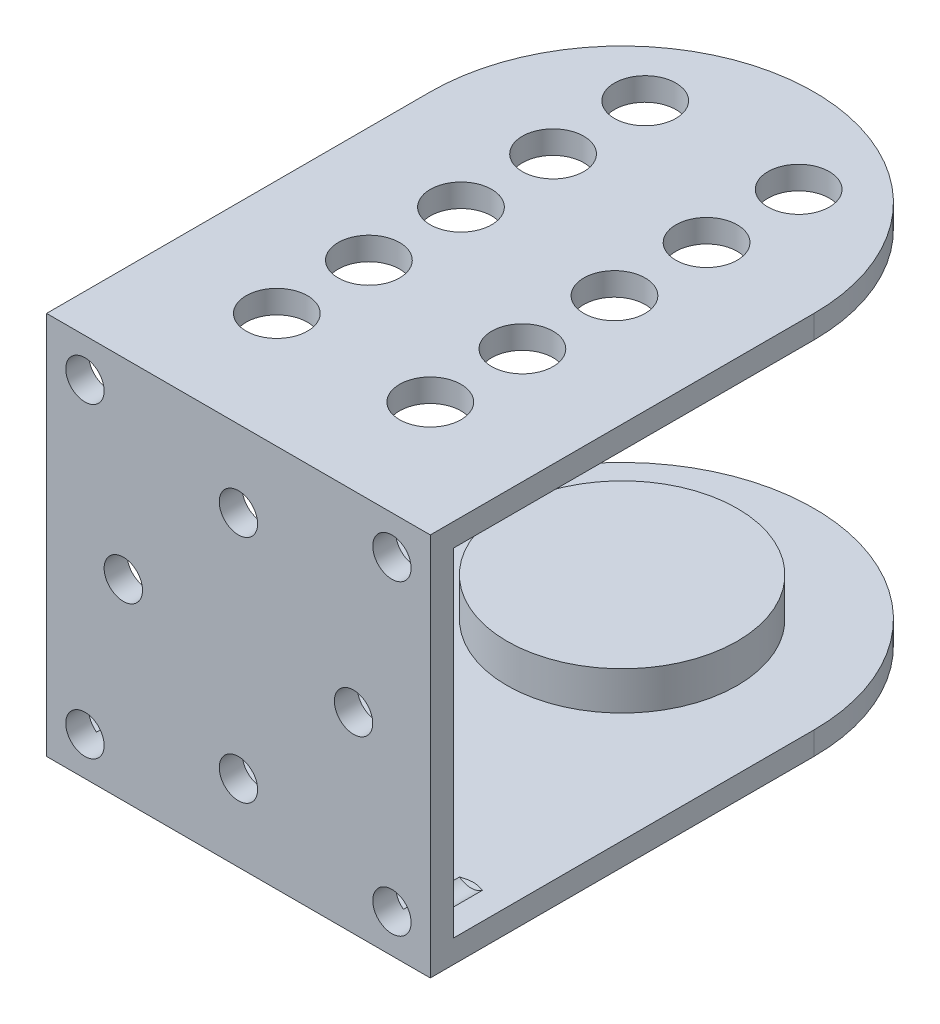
ISO-10303-21;
HEADER;
FILE_DESCRIPTION(('STEP AP214'),'2;1');
FILE_NAME('part.step','',(''),(''),'','','');
FILE_SCHEMA(('AUTOMOTIVE_DESIGN { 1 0 10303 214 1 1 1 1 }'));
ENDSEC;
DATA;
#1=APPLICATION_CONTEXT('core data for automotive mechanical design processes');
#2=APPLICATION_PROTOCOL_DEFINITION('international standard','automotive_design',2000,#1);
#3=PRODUCT_CONTEXT('',#1,'mechanical');
#4=PRODUCT('Part','Part','',(#3));
#5=PRODUCT_RELATED_PRODUCT_CATEGORY('part','',(#4));
#6=PRODUCT_DEFINITION_FORMATION('','',#4);
#7=PRODUCT_DEFINITION_CONTEXT('part definition',#1,'design');
#8=PRODUCT_DEFINITION('design','',#6,#7);
#9=PRODUCT_DEFINITION_SHAPE('','',#8);
#10=(LENGTH_UNIT() NAMED_UNIT(*) SI_UNIT(.MILLI.,.METRE.));
#11=(NAMED_UNIT(*) PLANE_ANGLE_UNIT() SI_UNIT($,.RADIAN.));
#12=(NAMED_UNIT(*) SI_UNIT($,.STERADIAN.) SOLID_ANGLE_UNIT());
#13=UNCERTAINTY_MEASURE_WITH_UNIT(LENGTH_MEASURE(1.E-05),#10,'distance_accuracy_value','');
#14=(GEOMETRIC_REPRESENTATION_CONTEXT(3) GLOBAL_UNCERTAINTY_ASSIGNED_CONTEXT((#13)) GLOBAL_UNIT_ASSIGNED_CONTEXT((#10,
#11,#12)) REPRESENTATION_CONTEXT('',''));
#15=CARTESIAN_POINT('',(0.,0.,0.));
#16=DIRECTION('',(0.,0.,1.));
#17=DIRECTION('',(1.,0.,0.));
#18=AXIS2_PLACEMENT_3D('',#15,#16,#17);
#19=CARTESIAN_POINT('',(25.,0.,-75.));
#20=DIRECTION('',(0.,-1.,0.));
#21=DIRECTION('',(0.,0.,-1.));
#22=AXIS2_PLACEMENT_3D('',#19,#20,#21);
#23=PLANE('',#22);
#24=DIRECTION('',(0.,0.,1.));
#25=VECTOR('',#24,1.);
#26=CARTESIAN_POINT('',(-25.,0.,-75.));
#27=LINE('',#26,#25);
#28=CARTESIAN_POINT('',(-25.,0.,-50.));
#29=VERTEX_POINT('',#28);
#30=CARTESIAN_POINT('',(-25.,0.,0.));
#31=VERTEX_POINT('',#30);
#32=EDGE_CURVE('E219',#29,#31,#27,.T.);
#33=ORIENTED_EDGE('',*,*,#32,.F.);
#34=CARTESIAN_POINT('',(0.,0.,-50.));
#35=DIRECTION('',(0.,-1.,0.));
#36=DIRECTION('',(0.,0.,-1.));
#37=AXIS2_PLACEMENT_3D('',#34,#35,#36);
#38=CIRCLE('',#37,25.);
#39=CARTESIAN_POINT('',(25.,0.,-50.));
#40=VERTEX_POINT('',#39);
#41=EDGE_CURVE('E50',#29,#40,#38,.T.);
#42=ORIENTED_EDGE('',*,*,#41,.T.);
#43=DIRECTION('',(0.,0.,1.));
#44=VECTOR('',#43,1.);
#45=CARTESIAN_POINT('',(25.,0.,-75.));
#46=LINE('',#45,#44);
#47=CARTESIAN_POINT('',(25.,0.,0.));
#48=VERTEX_POINT('',#47);
#49=EDGE_CURVE('E235',#40,#48,#46,.T.);
#50=ORIENTED_EDGE('',*,*,#49,.T.);
#51=DIRECTION('',(-1.,0.,0.));
#52=VECTOR('',#51,1.);
#53=CARTESIAN_POINT('',(25.,0.,0.));
#54=LINE('',#53,#52);
#55=EDGE_CURVE('E249',#48,#31,#54,.T.);
#56=ORIENTED_EDGE('',*,*,#55,.T.);
#57=EDGE_LOOP('',(#33,#42,#50,#56));
#58=FACE_BOUND('',#57,.T.);
#59=CARTESIAN_POINT('',(0.,0.,-50.));
#60=DIRECTION('',(0.,-1.,0.));
#61=DIRECTION('',(0.,0.,-1.));
#62=AXIS2_PLACEMENT_3D('',#59,#60,#61);
#63=CIRCLE('',#62,15.);
#64=CARTESIAN_POINT('',(0.,0.,-65.));
#65=VERTEX_POINT('',#64);
#66=EDGE_CURVE('E606',#65,#65,#63,.F.);
#67=ORIENTED_EDGE('',*,*,#66,.T.);
#68=EDGE_LOOP('',(#67));
#69=FACE_BOUND('',#68,.T.);
#70=ADVANCED_FACE('F35',(#58,#69),#23,.T.);
#71=CARTESIAN_POINT('',(25.,3.,-75.));
#72=DIRECTION('',(0.,-1.,0.));
#73=DIRECTION('',(0.,0.,-1.));
#74=AXIS2_PLACEMENT_3D('',#71,#72,#73);
#75=PLANE('',#74);
#76=DIRECTION('',(0.,0.,1.));
#77=VECTOR('',#76,1.);
#78=CARTESIAN_POINT('',(25.,3.,-75.));
#79=LINE('',#78,#77);
#80=CARTESIAN_POINT('',(25.,3.,-50.));
#81=VERTEX_POINT('',#80);
#82=CARTESIAN_POINT('',(25.,3.,-3.));
#83=VERTEX_POINT('',#82);
#84=EDGE_CURVE('E237',#81,#83,#79,.T.);
#85=ORIENTED_EDGE('',*,*,#84,.F.);
#86=CARTESIAN_POINT('',(0.,3.,-50.));
#87=DIRECTION('',(0.,-1.,0.));
#88=DIRECTION('',(0.,0.,-1.));
#89=AXIS2_PLACEMENT_3D('',#86,#87,#88);
#90=CIRCLE('',#89,25.);
#91=CARTESIAN_POINT('',(-25.,3.,-50.));
#92=VERTEX_POINT('',#91);
#93=EDGE_CURVE('E43',#81,#92,#90,.F.);
#94=ORIENTED_EDGE('',*,*,#93,.T.);
#95=DIRECTION('',(0.,0.,1.));
#96=VECTOR('',#95,1.);
#97=CARTESIAN_POINT('',(-25.,3.,-75.));
#98=LINE('',#97,#96);
#99=CARTESIAN_POINT('',(-25.,3.,-3.));
#100=VERTEX_POINT('',#99);
#101=EDGE_CURVE('E221',#92,#100,#98,.T.);
#102=ORIENTED_EDGE('',*,*,#101,.T.);
#103=DIRECTION('',(-1.,0.,0.));
#104=VECTOR('',#103,1.);
#105=CARTESIAN_POINT('',(25.,3.,-3.));
#106=LINE('',#105,#104);
#107=CARTESIAN_POINT('',(-21.5,3.,-3.));
#108=VERTEX_POINT('',#107);
#109=EDGE_CURVE('E245',#108,#100,#106,.T.);
#110=ORIENTED_EDGE('',*,*,#109,.F.);
#111=DIRECTION('',(0.,0.,1.));
#112=VECTOR('',#111,1.);
#113=CARTESIAN_POINT('',(-21.5,3.,0.));
#114=LINE('',#113,#112);
#115=CARTESIAN_POINT('',(-21.5,3.,-10.3));
#116=VERTEX_POINT('',#115);
#117=EDGE_CURVE('E205',#108,#116,#114,.F.);
#118=ORIENTED_EDGE('',*,*,#117,.T.);
#119=CARTESIAN_POINT('',(-32.564344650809,3.,-4.15768460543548));
#120=CARTESIAN_POINT('',(-32.1955445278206,3.,-4.37651484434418));
#121=CARTESIAN_POINT('',(-31.8266496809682,3.,-4.59518588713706));
#122=CARTESIAN_POINT('',(-31.0883780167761,3.,-5.03218355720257));
#123=CARTESIAN_POINT('',(-30.7190010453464,3.,-5.25050992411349));
#124=CARTESIAN_POINT('',(-29.9759834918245,3.,-5.68884875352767));
#125=CARTESIAN_POINT('',(-29.6023390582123,3.,-5.9088546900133));
#126=CARTESIAN_POINT('',(-28.8547419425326,3.,-6.34786768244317));
#127=CARTESIAN_POINT('',(-28.4807895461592,3.,-6.56687522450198));
#128=CARTESIAN_POINT('',(-27.8333055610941,3.,-6.94459519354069));
#129=CARTESIAN_POINT('',(-27.559948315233,3.,-7.10360632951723));
#130=CARTESIAN_POINT('',(-27.012696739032,3.,-7.42070103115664));
#131=CARTESIAN_POINT('',(-26.7388024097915,3.,-7.57878459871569));
#132=CARTESIAN_POINT('',(-26.1897178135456,3.,-7.89397081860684));
#133=CARTESIAN_POINT('',(-25.9145260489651,3.,-8.05107086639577));
#134=CARTESIAN_POINT('',(-25.3631163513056,3.,-8.36333250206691));
#135=CARTESIAN_POINT('',(-25.0868986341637,3.,-8.51849447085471));
#136=CARTESIAN_POINT('',(-24.5351718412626,3.,-8.82461487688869));
#137=CARTESIAN_POINT('',(-24.259676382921,3.,-8.97559770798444));
#138=CARTESIAN_POINT('',(-23.8444045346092,3.,-9.19856956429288));
#139=CARTESIAN_POINT('',(-23.7055854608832,3.,-9.27233914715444));
#140=CARTESIAN_POINT('',(-23.427115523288,3.,-9.41828232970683));
#141=CARTESIAN_POINT('',(-23.2874646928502,3.,-9.49045599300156));
#142=CARTESIAN_POINT('',(-23.0075975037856,3.,-9.632385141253));
#143=CARTESIAN_POINT('',(-22.8673852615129,3.,-9.70214871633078));
#144=CARTESIAN_POINT('',(-22.5854890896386,3.,-9.83872638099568));
#145=CARTESIAN_POINT('',(-22.4438048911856,3.,-9.90553991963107));
#146=CARTESIAN_POINT('',(-22.1587053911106,3.,-10.0348384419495));
#147=CARTESIAN_POINT('',(-22.0152928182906,3.,-10.0973294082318));
#148=CARTESIAN_POINT('',(-21.7259348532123,3.,-10.2161009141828));
#149=CARTESIAN_POINT('',(-21.5799906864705,3.,-10.2723843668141));
#150=CARTESIAN_POINT('',(-21.3789185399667,3.,-10.3427222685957));
#151=CARTESIAN_POINT('',(-21.3252045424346,3.,-10.3608247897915));
#152=CARTESIAN_POINT('',(-21.2173057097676,3.,-10.3956044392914));
#153=CARTESIAN_POINT('',(-21.1631208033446,3.,-10.4122813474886));
#154=CARTESIAN_POINT('',(-21.05428442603,3.,-10.4439867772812));
#155=CARTESIAN_POINT('',(-20.9996330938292,3.,-10.4590157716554));
#156=CARTESIAN_POINT('',(-20.8898493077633,3.,-10.4871907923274));
#157=CARTESIAN_POINT('',(-20.8347168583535,3.,-10.5003368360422));
#158=CARTESIAN_POINT('',(-20.6717568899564,3.,-10.5358857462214));
#159=CARTESIAN_POINT('',(-20.563256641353,3.,-10.5553300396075));
#160=CARTESIAN_POINT('',(-20.3448840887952,3.,-10.5843661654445));
#161=CARTESIAN_POINT('',(-20.2350116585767,3.,-10.5939570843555));
#162=CARTESIAN_POINT('',(-20.0621786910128,3.,-10.6004429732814));
#163=CARTESIAN_POINT('',(-19.9993415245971,3.,-10.6010219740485));
#164=CARTESIAN_POINT('',(-19.8737341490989,3.,-10.5986289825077));
#165=CARTESIAN_POINT('',(-19.8109639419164,3.,-10.5956568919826));
#166=CARTESIAN_POINT('',(-19.6230624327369,3.,-10.5815463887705));
#167=CARTESIAN_POINT('',(-19.4983001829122,3.,-10.5652151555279));
#168=CARTESIAN_POINT('',(-19.2475097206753,3.,-10.5202721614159));
#169=CARTESIAN_POINT('',(-19.1215434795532,3.,-10.4913301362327));
#170=CARTESIAN_POINT('',(-18.9345088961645,3.,-10.4409447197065));
#171=CARTESIAN_POINT('',(-18.8724642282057,3.,-10.4229808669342));
#172=CARTESIAN_POINT('',(-18.74898936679,3.,-10.3850610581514));
#173=CARTESIAN_POINT('',(-18.6875591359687,3.,-10.365105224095));
#174=CARTESIAN_POINT('',(-18.5088685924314,3.,-10.3043255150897));
#175=CARTESIAN_POINT('',(-18.3923813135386,3.,-10.2612330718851));
#176=CARTESIAN_POINT('',(-18.1611618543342,3.,-10.1705450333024));
#177=CARTESIAN_POINT('',(-18.0464302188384,3.,-10.1229480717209));
#178=CARTESIAN_POINT('',(-17.8182759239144,3.,-10.0244134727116));
#179=CARTESIAN_POINT('',(-17.704854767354,3.,-9.97347237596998));
#180=CARTESIAN_POINT('',(-17.4791621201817,3.,-9.8691508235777));
#181=CARTESIAN_POINT('',(-17.366890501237,3.,-9.81577064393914));
#182=CARTESIAN_POINT('',(-17.1428220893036,3.,-9.70695672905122));
#183=CARTESIAN_POINT('',(-17.0310287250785,3.,-9.65151595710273));
#184=CARTESIAN_POINT('',(-16.8081641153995,3.,-9.5391992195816));
#185=CARTESIAN_POINT('',(-16.6970928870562,3.,-9.48232322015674));
#186=CARTESIAN_POINT('',(-16.3648763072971,3.,-9.31010116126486));
#187=CARTESIAN_POINT('',(-16.1445927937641,3.,-9.19309431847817));
#188=CARTESIAN_POINT('',(-15.7343157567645,3.,-8.97177927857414));
#189=CARTESIAN_POINT('',(-15.5441349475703,3.,-8.86781578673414));
#190=CARTESIAN_POINT('',(-15.1645838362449,3.,-8.65834609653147));
#191=CARTESIAN_POINT('',(-14.9752136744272,3.,-8.55283964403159));
#192=CARTESIAN_POINT('',(-14.5985504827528,3.,-8.34153172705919));
#193=CARTESIAN_POINT('',(-14.4112526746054,3.,-8.23573876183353));
#194=CARTESIAN_POINT('',(-14.037171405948,3.,-8.02333126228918));
#195=CARTESIAN_POINT('',(-13.8503878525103,3.,-7.91671689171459));
#196=CARTESIAN_POINT('',(-13.6637749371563,3.,-7.80980696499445));
#197=B_SPLINE_CURVE_WITH_KNOTS('',3,(#119,#120,#121,#122,#123,#124,#125,#126,#127,#128,#129,
#130,#131,#132,#133,#134,#135,#136,#137,#138,#139,#140,#141,#142,#143,#144,#145,#146,#147,#148,
#149,#150,#151,#152,#153,#154,#155,#156,#157,#158,#159,#160,#161,#162,#163,#164,#165,#166,#167,
#168,#169,#170,#171,#172,#173,#174,#175,#176,#177,#178,#179,#180,#181,#182,#183,#184,#185,#186,
#187,#188,#189,#190,#191,#192,#193,#194,#195,#196),.UNSPECIFIED.,.F.,.F.,(4,2,2,2,2,2,2,2,2,2,2,
2,2,2,2,2,2,2,2,2,2,2,2,2,2,2,2,2,2,2,2,2,2,2,2,2,2,2,4),(0.,1.28650791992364,2.57373391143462,
3.87454632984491,5.17463765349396,6.12336102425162,7.07208245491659,8.0227074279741,
8.97314253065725,9.91557464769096,10.3871754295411,10.8587573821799,11.3285616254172,
11.7984532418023,12.2676809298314,12.7366874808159,12.906718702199,13.0767761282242,
13.2467846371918,13.4167915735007,13.7470893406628,14.077417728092,14.2658433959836,
14.4542742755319,14.8310164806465,15.2182813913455,15.4120340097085,15.6057747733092,
15.9782372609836,16.3508130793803,16.7237805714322,17.0967059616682,17.4710493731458,
17.8454016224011,18.5936537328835,19.2438734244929,19.8942014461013,20.5395313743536,
21.1847358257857),.UNSPECIFIED.);
#198=CARTESIAN_POINT('',(-18.5,3.,-10.3));
#199=VERTEX_POINT('',#198);
#200=EDGE_CURVE('E258',#116,#199,#197,.T.);
#201=ORIENTED_EDGE('',*,*,#200,.T.);
#202=DIRECTION('',(0.,0.,1.));
#203=VECTOR('',#202,1.);
#204=CARTESIAN_POINT('',(-18.5,3.,0.));
#205=LINE('',#204,#203);
#206=CARTESIAN_POINT('',(-18.5,3.,-3.));
#207=VERTEX_POINT('',#206);
#208=EDGE_CURVE('E208',#199,#207,#205,.T.);
#209=ORIENTED_EDGE('',*,*,#208,.T.);
#210=CARTESIAN_POINT('',(18.5,3.,-3.));
#211=VERTEX_POINT('',#210);
#212=EDGE_CURVE('E250',#211,#207,#106,.T.);
#213=ORIENTED_EDGE('',*,*,#212,.F.);
#214=DIRECTION('',(0.,0.,1.));
#215=VECTOR('',#214,1.);
#216=CARTESIAN_POINT('',(18.5,3.,0.));
#217=LINE('',#216,#215);
#218=CARTESIAN_POINT('',(18.5,3.,-10.3));
#219=VERTEX_POINT('',#218);
#220=EDGE_CURVE('E193',#211,#219,#217,.F.);
#221=ORIENTED_EDGE('',*,*,#220,.T.);
#222=CARTESIAN_POINT('',(7.43565534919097,3.,-4.15768460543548));
#223=CARTESIAN_POINT('',(7.80445547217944,3.,-4.37651484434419));
#224=CARTESIAN_POINT('',(8.1733503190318,3.,-4.59518588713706));
#225=CARTESIAN_POINT('',(8.91162198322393,3.,-5.03218355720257));
#226=CARTESIAN_POINT('',(9.28099895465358,3.,-5.25050992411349));
#227=CARTESIAN_POINT('',(10.0240165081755,3.,-5.68884875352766));
#228=CARTESIAN_POINT('',(10.3976609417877,3.,-5.9088546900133));
#229=CARTESIAN_POINT('',(11.1452580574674,3.,-6.34786768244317));
#230=CARTESIAN_POINT('',(11.5192104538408,3.,-6.56687522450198));
#231=CARTESIAN_POINT('',(12.1666944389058,3.,-6.94459519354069));
#232=CARTESIAN_POINT('',(12.440051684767,3.,-7.10360632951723));
#233=CARTESIAN_POINT('',(12.987303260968,3.,-7.42070103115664));
#234=CARTESIAN_POINT('',(13.2611975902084,3.,-7.57878459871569));
#235=CARTESIAN_POINT('',(13.8102821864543,3.,-7.89397081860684));
#236=CARTESIAN_POINT('',(14.0854739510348,3.,-8.05107086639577));
#237=CARTESIAN_POINT('',(14.6368836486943,3.,-8.3633325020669));
#238=CARTESIAN_POINT('',(14.9131013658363,3.,-8.51849447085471));
#239=CARTESIAN_POINT('',(15.4648281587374,3.,-8.82461487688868));
#240=CARTESIAN_POINT('',(15.740323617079,3.,-8.97559770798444));
#241=CARTESIAN_POINT('',(16.1555954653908,3.,-9.19856956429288));
#242=CARTESIAN_POINT('',(16.2944145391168,3.,-9.27233914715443));
#243=CARTESIAN_POINT('',(16.572884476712,3.,-9.41828232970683));
#244=CARTESIAN_POINT('',(16.7125353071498,3.,-9.49045599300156));
#245=CARTESIAN_POINT('',(16.9924024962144,3.,-9.632385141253));
#246=CARTESIAN_POINT('',(17.1326147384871,3.,-9.70214871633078));
#247=CARTESIAN_POINT('',(17.4145109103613,3.,-9.83872638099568));
#248=CARTESIAN_POINT('',(17.5561951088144,3.,-9.90553991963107));
#249=CARTESIAN_POINT('',(17.8412946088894,3.,-10.0348384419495));
#250=CARTESIAN_POINT('',(17.9847071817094,3.,-10.0973294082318));
#251=CARTESIAN_POINT('',(18.2740651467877,3.,-10.2161009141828));
#252=CARTESIAN_POINT('',(18.4200093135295,3.,-10.2723843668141));
#253=CARTESIAN_POINT('',(18.6210814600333,3.,-10.3427222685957));
#254=CARTESIAN_POINT('',(18.6747954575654,3.,-10.3608247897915));
#255=CARTESIAN_POINT('',(18.7826942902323,3.,-10.3956044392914));
#256=CARTESIAN_POINT('',(18.8368791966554,3.,-10.4122813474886));
#257=CARTESIAN_POINT('',(18.94571557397,3.,-10.4439867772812));
#258=CARTESIAN_POINT('',(19.0003669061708,3.,-10.4590157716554));
#259=CARTESIAN_POINT('',(19.1101506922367,3.,-10.4871907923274));
#260=CARTESIAN_POINT('',(19.1652831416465,3.,-10.5003368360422));
#261=CARTESIAN_POINT('',(19.3282431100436,3.,-10.5358857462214));
#262=CARTESIAN_POINT('',(19.436743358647,3.,-10.5553300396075));
#263=CARTESIAN_POINT('',(19.6551159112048,3.,-10.5843661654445));
#264=CARTESIAN_POINT('',(19.7649883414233,3.,-10.5939570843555));
#265=CARTESIAN_POINT('',(19.9378213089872,3.,-10.6004429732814));
#266=CARTESIAN_POINT('',(20.0006584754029,3.,-10.6010219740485));
#267=CARTESIAN_POINT('',(20.1262658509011,3.,-10.5986289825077));
#268=CARTESIAN_POINT('',(20.1890360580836,3.,-10.5956568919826));
#269=CARTESIAN_POINT('',(20.3769375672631,3.,-10.5815463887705));
#270=CARTESIAN_POINT('',(20.5016998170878,3.,-10.5652151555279));
#271=CARTESIAN_POINT('',(20.7524902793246,3.,-10.5202721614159));
#272=CARTESIAN_POINT('',(20.8784565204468,3.,-10.4913301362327));
#273=CARTESIAN_POINT('',(21.0654911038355,3.,-10.4409447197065));
#274=CARTESIAN_POINT('',(21.1275357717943,3.,-10.4229808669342));
#275=CARTESIAN_POINT('',(21.25101063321,3.,-10.3850610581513));
#276=CARTESIAN_POINT('',(21.3124408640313,3.,-10.365105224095));
#277=CARTESIAN_POINT('',(21.4911314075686,3.,-10.3043255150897));
#278=CARTESIAN_POINT('',(21.6076186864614,3.,-10.2612330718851));
#279=CARTESIAN_POINT('',(21.8388381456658,3.,-10.1705450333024));
#280=CARTESIAN_POINT('',(21.9535697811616,3.,-10.1229480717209));
#281=CARTESIAN_POINT('',(22.1817240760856,3.,-10.0244134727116));
#282=CARTESIAN_POINT('',(22.295145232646,3.,-9.97347237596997));
#283=CARTESIAN_POINT('',(22.5208378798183,3.,-9.86915082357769));
#284=CARTESIAN_POINT('',(22.633109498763,3.,-9.81577064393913));
#285=CARTESIAN_POINT('',(22.8571779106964,3.,-9.70695672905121));
#286=CARTESIAN_POINT('',(22.9689712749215,3.,-9.65151595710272));
#287=CARTESIAN_POINT('',(23.1918358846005,3.,-9.53919921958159));
#288=CARTESIAN_POINT('',(23.3029071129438,3.,-9.48232322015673));
#289=CARTESIAN_POINT('',(23.6351236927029,3.,-9.31010116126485));
#290=CARTESIAN_POINT('',(23.8554072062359,3.,-9.19309431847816));
#291=CARTESIAN_POINT('',(24.2656842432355,3.,-8.97177927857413));
#292=CARTESIAN_POINT('',(24.4558650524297,3.,-8.86781578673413));
#293=CARTESIAN_POINT('',(24.8354161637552,3.,-8.65834609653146));
#294=CARTESIAN_POINT('',(25.0247863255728,3.,-8.55283964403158));
#295=CARTESIAN_POINT('',(25.4014495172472,3.,-8.34153172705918));
#296=CARTESIAN_POINT('',(25.5887473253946,3.,-8.23573876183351));
#297=CARTESIAN_POINT('',(25.962828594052,3.,-8.02333126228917));
#298=CARTESIAN_POINT('',(26.1496121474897,3.,-7.91671689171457));
#299=CARTESIAN_POINT('',(26.3362250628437,3.,-7.80980696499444));
#300=B_SPLINE_CURVE_WITH_KNOTS('',3,(#222,#223,#224,#225,#226,#227,#228,#229,#230,#231,#232,
#233,#234,#235,#236,#237,#238,#239,#240,#241,#242,#243,#244,#245,#246,#247,#248,#249,#250,#251,
#252,#253,#254,#255,#256,#257,#258,#259,#260,#261,#262,#263,#264,#265,#266,#267,#268,#269,#270,
#271,#272,#273,#274,#275,#276,#277,#278,#279,#280,#281,#282,#283,#284,#285,#286,#287,#288,#289,
#290,#291,#292,#293,#294,#295,#296,#297,#298,#299),.UNSPECIFIED.,.F.,.F.,(4,2,2,2,2,2,2,2,2,2,2,
2,2,2,2,2,2,2,2,2,2,2,2,2,2,2,2,2,2,2,2,2,2,2,2,2,2,2,4),(0.,1.28650791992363,2.57373391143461,
3.8745463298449,5.17463765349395,6.12336102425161,7.07208245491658,8.02270742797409,
8.97314253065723,9.91557464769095,10.3871754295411,10.8587573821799,11.3285616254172,
11.7984532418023,12.2676809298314,12.7366874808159,12.906718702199,13.0767761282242,
13.2467846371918,13.4167915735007,13.7470893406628,14.0774177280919,14.2658433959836,
14.4542742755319,14.8310164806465,15.2182813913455,15.4120340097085,15.6057747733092,
15.9782372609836,16.3508130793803,16.7237805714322,17.0967059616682,17.4710493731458,
17.8454016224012,18.5936537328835,19.243873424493,19.8942014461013,20.5395313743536,
21.1847358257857),.UNSPECIFIED.);
#301=CARTESIAN_POINT('',(21.5,3.,-10.3));
#302=VERTEX_POINT('',#301);
#303=EDGE_CURVE('E353',#219,#302,#300,.T.);
#304=ORIENTED_EDGE('',*,*,#303,.T.);
#305=DIRECTION('',(0.,0.,1.));
#306=VECTOR('',#305,1.);
#307=CARTESIAN_POINT('',(21.5,3.,0.));
#308=LINE('',#307,#306);
#309=CARTESIAN_POINT('',(21.5,3.,-3.));
#310=VERTEX_POINT('',#309);
#311=EDGE_CURVE('E196',#302,#310,#308,.T.);
#312=ORIENTED_EDGE('',*,*,#311,.T.);
#313=EDGE_CURVE('E246',#83,#310,#106,.T.);
#314=ORIENTED_EDGE('',*,*,#313,.F.);
#315=EDGE_LOOP('',(#85,#94,#102,#110,#118,#201,#209,#213,#221,#304,#312,#314));
#316=FACE_BOUND('',#315,.T.);
#317=CARTESIAN_POINT('',(0.,3.,-50.));
#318=DIRECTION('',(0.,-1.,0.));
#319=DIRECTION('',(0.,0.,-1.));
#320=AXIS2_PLACEMENT_3D('',#317,#318,#319);
#321=CIRCLE('',#320,15.);
#322=CARTESIAN_POINT('',(0.,3.,-65.));
#323=VERTEX_POINT('',#322);
#324=EDGE_CURVE('E12',#323,#323,#321,.F.);
#325=ORIENTED_EDGE('',*,*,#324,.F.);
#326=EDGE_LOOP('',(#325));
#327=FACE_BOUND('',#326,.T.);
#328=ADVANCED_FACE('F268',(#316,#327),#75,.F.);
#329=CARTESIAN_POINT('',(0.,0.,-50.));
#330=DIRECTION('',(0.,-1.,0.));
#331=DIRECTION('',(0.,0.,-1.));
#332=AXIS2_PLACEMENT_3D('',#329,#330,#331);
#333=CYLINDRICAL_SURFACE('',#332,25.);
#334=DIRECTION('',(0.,1.,0.));
#335=VECTOR('',#334,1.);
#336=CARTESIAN_POINT('',(25.,0.,-50.));
#337=LINE('',#336,#335);
#338=EDGE_CURVE('E383',#40,#81,#337,.T.);
#339=ORIENTED_EDGE('',*,*,#338,.F.);
#340=ORIENTED_EDGE('',*,*,#41,.F.);
#341=DIRECTION('',(0.,-1.,0.));
#342=VECTOR('',#341,1.);
#343=CARTESIAN_POINT('',(-25.,47.,-50.));
#344=LINE('',#343,#342);
#345=EDGE_CURVE('E386',#92,#29,#344,.T.);
#346=ORIENTED_EDGE('',*,*,#345,.F.);
#347=ORIENTED_EDGE('',*,*,#93,.F.);
#348=EDGE_LOOP('',(#339,#340,#346,#347));
#349=FACE_BOUND('',#348,.T.);
#350=ADVANCED_FACE('F37',(#349),#333,.T.);
#351=CARTESIAN_POINT('',(0.,47.,-50.));
#352=DIRECTION('',(0.,-1.,0.));
#353=DIRECTION('',(0.,0.,-1.));
#354=AXIS2_PLACEMENT_3D('',#351,#352,#353);
#355=CYLINDRICAL_SURFACE('',#354,25.);
#356=DIRECTION('',(0.,1.,0.));
#357=VECTOR('',#356,1.);
#358=CARTESIAN_POINT('',(25.,47.,-50.));
#359=LINE('',#358,#357);
#360=CARTESIAN_POINT('',(25.,47.,-50.));
#361=VERTEX_POINT('',#360);
#362=CARTESIAN_POINT('',(25.,50.,-50.));
#363=VERTEX_POINT('',#362);
#364=EDGE_CURVE('E154',#361,#363,#359,.T.);
#365=ORIENTED_EDGE('',*,*,#364,.F.);
#366=CARTESIAN_POINT('',(0.,47.,-50.));
#367=DIRECTION('',(0.,1.,0.));
#368=DIRECTION('',(0.,0.,1.));
#369=AXIS2_PLACEMENT_3D('',#366,#367,#368);
#370=CIRCLE('',#369,25.);
#371=CARTESIAN_POINT('',(-25.,47.,-50.));
#372=VERTEX_POINT('',#371);
#373=EDGE_CURVE('E374',#372,#361,#370,.F.);
#374=ORIENTED_EDGE('',*,*,#373,.F.);
#375=DIRECTION('',(0.,-1.,0.));
#376=VECTOR('',#375,1.);
#377=CARTESIAN_POINT('',(-25.,47.,-50.));
#378=LINE('',#377,#376);
#379=CARTESIAN_POINT('',(-25.,50.,-50.));
#380=VERTEX_POINT('',#379);
#381=EDGE_CURVE('E371',#380,#372,#378,.T.);
#382=ORIENTED_EDGE('',*,*,#381,.F.);
#383=CARTESIAN_POINT('',(0.,50.,-50.));
#384=DIRECTION('',(0.,1.,0.));
#385=DIRECTION('',(0.,0.,1.));
#386=AXIS2_PLACEMENT_3D('',#383,#384,#385);
#387=CIRCLE('',#386,25.);
#388=EDGE_CURVE('E376',#363,#380,#387,.T.);
#389=ORIENTED_EDGE('',*,*,#388,.F.);
#390=EDGE_LOOP('',(#365,#374,#382,#389));
#391=FACE_BOUND('',#390,.T.);
#392=ADVANCED_FACE('F317',(#391),#355,.T.);
#393=CARTESIAN_POINT('',(25.,47.,0.));
#394=DIRECTION('',(0.,1.,0.));
#395=DIRECTION('',(0.,0.,1.));
#396=AXIS2_PLACEMENT_3D('',#393,#394,#395);
#397=PLANE('',#396);
#398=CARTESIAN_POINT('',(-10.,47.,-63.));
#399=DIRECTION('',(0.,1.,0.));
#400=DIRECTION('',(0.,0.,1.));
#401=AXIS2_PLACEMENT_3D('',#398,#399,#400);
#402=CIRCLE('',#401,4.);
#403=CARTESIAN_POINT('',(-10.,47.,-59.));
#404=VERTEX_POINT('',#403);
#405=EDGE_CURVE('E600',#404,#404,#402,.T.);
#406=ORIENTED_EDGE('',*,*,#405,.T.);
#407=EDGE_LOOP('',(#406));
#408=FACE_BOUND('',#407,.T.);
#409=CARTESIAN_POINT('',(-10.,47.,-51.));
#410=DIRECTION('',(0.,1.,0.));
#411=DIRECTION('',(0.,0.,1.));
#412=AXIS2_PLACEMENT_3D('',#409,#410,#411);
#413=CIRCLE('',#412,4.);
#414=CARTESIAN_POINT('',(-10.,47.,-47.));
#415=VERTEX_POINT('',#414);
#416=EDGE_CURVE('E594',#415,#415,#413,.T.);
#417=ORIENTED_EDGE('',*,*,#416,.T.);
#418=EDGE_LOOP('',(#417));
#419=FACE_BOUND('',#418,.T.);
#420=CARTESIAN_POINT('',(-10.,47.,-39.));
#421=DIRECTION('',(0.,1.,0.));
#422=DIRECTION('',(0.,0.,1.));
#423=AXIS2_PLACEMENT_3D('',#420,#421,#422);
#424=CIRCLE('',#423,4.);
#425=CARTESIAN_POINT('',(-10.,47.,-35.));
#426=VERTEX_POINT('',#425);
#427=EDGE_CURVE('E588',#426,#426,#424,.T.);
#428=ORIENTED_EDGE('',*,*,#427,.T.);
#429=EDGE_LOOP('',(#428));
#430=FACE_BOUND('',#429,.T.);
#431=CARTESIAN_POINT('',(-10.,47.,-27.));
#432=DIRECTION('',(0.,1.,0.));
#433=DIRECTION('',(0.,0.,1.));
#434=AXIS2_PLACEMENT_3D('',#431,#432,#433);
#435=CIRCLE('',#434,4.);
#436=CARTESIAN_POINT('',(-10.,47.,-23.));
#437=VERTEX_POINT('',#436);
#438=EDGE_CURVE('E582',#437,#437,#435,.T.);
#439=ORIENTED_EDGE('',*,*,#438,.T.);
#440=EDGE_LOOP('',(#439));
#441=FACE_BOUND('',#440,.T.);
#442=CARTESIAN_POINT('',(10.,47.,-63.));
#443=DIRECTION('',(0.,1.,0.));
#444=DIRECTION('',(0.,0.,1.));
#445=AXIS2_PLACEMENT_3D('',#442,#443,#444);
#446=CIRCLE('',#445,4.);
#447=CARTESIAN_POINT('',(10.,47.,-59.));
#448=VERTEX_POINT('',#447);
#449=EDGE_CURVE('E576',#448,#448,#446,.T.);
#450=ORIENTED_EDGE('',*,*,#449,.T.);
#451=EDGE_LOOP('',(#450));
#452=FACE_BOUND('',#451,.T.);
#453=CARTESIAN_POINT('',(10.,47.,-51.));
#454=DIRECTION('',(0.,1.,0.));
#455=DIRECTION('',(0.,0.,1.));
#456=AXIS2_PLACEMENT_3D('',#453,#454,#455);
#457=CIRCLE('',#456,4.);
#458=CARTESIAN_POINT('',(10.,47.,-47.));
#459=VERTEX_POINT('',#458);
#460=EDGE_CURVE('E570',#459,#459,#457,.T.);
#461=ORIENTED_EDGE('',*,*,#460,.T.);
#462=EDGE_LOOP('',(#461));
#463=FACE_BOUND('',#462,.T.);
#464=CARTESIAN_POINT('',(10.,47.,-39.));
#465=DIRECTION('',(0.,1.,0.));
#466=DIRECTION('',(0.,0.,1.));
#467=AXIS2_PLACEMENT_3D('',#464,#465,#466);
#468=CIRCLE('',#467,4.);
#469=CARTESIAN_POINT('',(10.,47.,-35.));
#470=VERTEX_POINT('',#469);
#471=EDGE_CURVE('E564',#470,#470,#468,.T.);
#472=ORIENTED_EDGE('',*,*,#471,.T.);
#473=EDGE_LOOP('',(#472));
#474=FACE_BOUND('',#473,.T.);
#475=CARTESIAN_POINT('',(10.,47.,-27.));
#476=DIRECTION('',(0.,1.,0.));
#477=DIRECTION('',(0.,0.,1.));
#478=AXIS2_PLACEMENT_3D('',#475,#476,#477);
#479=CIRCLE('',#478,4.);
#480=CARTESIAN_POINT('',(10.,47.,-23.));
#481=VERTEX_POINT('',#480);
#482=EDGE_CURVE('E558',#481,#481,#479,.T.);
#483=ORIENTED_EDGE('',*,*,#482,.T.);
#484=EDGE_LOOP('',(#483));
#485=FACE_BOUND('',#484,.T.);
#486=CARTESIAN_POINT('',(10.,47.,-15.));
#487=DIRECTION('',(0.,1.,0.));
#488=DIRECTION('',(0.,0.,1.));
#489=AXIS2_PLACEMENT_3D('',#486,#487,#488);
#490=CIRCLE('',#489,4.);
#491=CARTESIAN_POINT('',(10.,47.,-11.));
#492=VERTEX_POINT('',#491);
#493=EDGE_CURVE('E552',#492,#492,#490,.T.);
#494=ORIENTED_EDGE('',*,*,#493,.T.);
#495=EDGE_LOOP('',(#494));
#496=FACE_BOUND('',#495,.T.);
#497=CARTESIAN_POINT('',(-10.,47.,-15.));
#498=DIRECTION('',(0.,1.,0.));
#499=DIRECTION('',(0.,0.,1.));
#500=AXIS2_PLACEMENT_3D('',#497,#498,#499);
#501=CIRCLE('',#500,4.);
#502=CARTESIAN_POINT('',(-10.,47.,-11.));
#503=VERTEX_POINT('',#502);
#504=EDGE_CURVE('E543',#503,#503,#501,.T.);
#505=ORIENTED_EDGE('',*,*,#504,.T.);
#506=EDGE_LOOP('',(#505));
#507=FACE_BOUND('',#506,.T.);
#508=DIRECTION('',(0.,0.,-1.));
#509=VECTOR('',#508,1.);
#510=CARTESIAN_POINT('',(-25.,47.,0.));
#511=LINE('',#510,#509);
#512=CARTESIAN_POINT('',(-25.,47.,-3.));
#513=VERTEX_POINT('',#512);
#514=EDGE_CURVE('E211',#513,#372,#511,.T.);
#515=ORIENTED_EDGE('',*,*,#514,.T.);
#516=ORIENTED_EDGE('',*,*,#373,.T.);
#517=DIRECTION('',(0.,0.,-1.));
#518=VECTOR('',#517,1.);
#519=CARTESIAN_POINT('',(25.,47.,0.));
#520=LINE('',#519,#518);
#521=CARTESIAN_POINT('',(25.,47.,-3.));
#522=VERTEX_POINT('',#521);
#523=EDGE_CURVE('E226',#522,#361,#520,.T.);
#524=ORIENTED_EDGE('',*,*,#523,.F.);
#525=DIRECTION('',(-1.,0.,0.));
#526=VECTOR('',#525,1.);
#527=CARTESIAN_POINT('',(25.,47.,-3.));
#528=LINE('',#527,#526);
#529=CARTESIAN_POINT('',(21.5,47.,-3.));
#530=VERTEX_POINT('',#529);
#531=EDGE_CURVE('E242',#522,#530,#528,.T.);
#532=ORIENTED_EDGE('',*,*,#531,.T.);
#533=DIRECTION('',(0.,0.,1.));
#534=VECTOR('',#533,1.);
#535=CARTESIAN_POINT('',(21.5,47.,0.));
#536=LINE('',#535,#534);
#537=CARTESIAN_POINT('',(21.5,47.,-10.3));
#538=VERTEX_POINT('',#537);
#539=EDGE_CURVE('E182',#530,#538,#536,.F.);
#540=ORIENTED_EDGE('',*,*,#539,.T.);
#541=CARTESIAN_POINT('',(7.43565538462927,47.,-4.15768462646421));
#542=CARTESIAN_POINT('',(7.80445550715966,47.,-4.37651486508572));
#543=CARTESIAN_POINT('',(8.17335035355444,47.,-4.59518590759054));
#544=CARTESIAN_POINT('',(8.91162201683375,47.,-5.03218357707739));
#545=CARTESIAN_POINT('',(9.28099898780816,47.,-5.25050994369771));
#546=CARTESIAN_POINT('',(10.0240165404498,47.,-5.68884877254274));
#547=CARTESIAN_POINT('',(10.3976609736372,47.,-5.90885470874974));
#548=CARTESIAN_POINT('',(11.1452580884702,47.,-6.34786770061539));
#549=CARTESIAN_POINT('',(11.5192104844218,47.,-6.56687524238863));
#550=CARTESIAN_POINT('',(12.1666944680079,47.,-6.94459521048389));
#551=CARTESIAN_POINT('',(12.4400517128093,47.,-7.10360634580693));
#552=CARTESIAN_POINT('',(12.9873032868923,47.,-7.4207010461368));
#553=CARTESIAN_POINT('',(13.2611976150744,47.,-7.5787846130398));
#554=CARTESIAN_POINT('',(13.8102822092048,47.,-7.89397083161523));
#555=CARTESIAN_POINT('',(14.0854739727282,47.,-8.05107087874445));
#556=CARTESIAN_POINT('',(14.6368836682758,47.,-8.36333251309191));
#557=CARTESIAN_POINT('',(14.9131013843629,47.,-8.51849448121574));
#558=CARTESIAN_POINT('',(15.4648281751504,47.,-8.82461488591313));
#559=CARTESIAN_POINT('',(15.7403236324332,47.,-8.97559771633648));
#560=CARTESIAN_POINT('',(16.1555954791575,47.,-9.19856957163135));
#561=CARTESIAN_POINT('',(16.2944145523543,47.,-9.27233915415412));
#562=CARTESIAN_POINT('',(16.5728844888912,47.,-9.41828233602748));
#563=CARTESIAN_POINT('',(16.7125353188,47.,-9.49045599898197));
#564=CARTESIAN_POINT('',(16.9924025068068,47.,-9.63238514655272));
#565=CARTESIAN_POINT('',(17.1326147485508,47.,-9.70214872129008));
#566=CARTESIAN_POINT('',(17.4145109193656,47.,-9.83872638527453));
#567=CARTESIAN_POINT('',(17.5561951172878,47.,-9.90553992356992));
#568=CARTESIAN_POINT('',(17.8412946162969,47.,-10.034838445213));
#569=CARTESIAN_POINT('',(17.984707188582,47.,-10.09732941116));
#570=CARTESIAN_POINT('',(18.2740651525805,47.,-10.2161009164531));
#571=CARTESIAN_POINT('',(18.4200093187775,47.,-10.2723843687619));
#572=CARTESIAN_POINT('',(18.6210814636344,47.,-10.3427222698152));
#573=CARTESIAN_POINT('',(18.6747954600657,47.,-10.360824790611));
#574=CARTESIAN_POINT('',(18.7826942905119,47.,-10.3956044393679));
#575=CARTESIAN_POINT('',(18.8368791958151,47.,-10.4122813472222));
#576=CARTESIAN_POINT('',(18.9457155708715,47.,-10.4439867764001));
#577=CARTESIAN_POINT('',(19.000366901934,47.,-10.4590157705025));
#578=CARTESIAN_POINT('',(19.1101506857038,47.,-10.4871907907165));
#579=CARTESIAN_POINT('',(19.1652831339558,47.,-10.500336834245));
#580=CARTESIAN_POINT('',(19.3282430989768,47.,-10.5358857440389));
#581=CARTESIAN_POINT('',(19.4367433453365,47.,-10.5553300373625));
#582=CARTESIAN_POINT('',(19.6551158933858,47.,-10.5843661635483));
#583=CARTESIAN_POINT('',(19.7649883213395,47.,-10.5939570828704));
#584=CARTESIAN_POINT('',(19.9378212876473,47.,-10.6004429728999));
#585=CARTESIAN_POINT('',(20.0006584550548,47.,-10.6010219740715));
#586=CARTESIAN_POINT('',(20.1262658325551,47.,-10.598628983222));
#587=CARTESIAN_POINT('',(20.1890360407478,47.,-10.5956568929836));
#588=CARTESIAN_POINT('',(20.376937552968,47.,-10.5815463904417));
#589=CARTESIAN_POINT('',(20.5016998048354,47.,-10.5652151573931));
#590=CARTESIAN_POINT('',(20.7524902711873,47.,-10.5202721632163));
#591=CARTESIAN_POINT('',(20.8784565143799,47.,-10.491330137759));
#592=CARTESIAN_POINT('',(21.0654911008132,47.,-10.4409447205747));
#593=CARTESIAN_POINT('',(21.1275357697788,47.,-10.4229808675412));
#594=CARTESIAN_POINT('',(21.2510106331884,47.,-10.38506105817));
#595=CARTESIAN_POINT('',(21.3124408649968,47.,-10.3651052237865));
#596=CARTESIAN_POINT('',(21.4911314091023,47.,-10.3043255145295));
#597=CARTESIAN_POINT('',(21.6076186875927,47.,-10.2612330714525));
#598=CARTESIAN_POINT('',(21.8388381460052,47.,-10.1705450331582));
#599=CARTESIAN_POINT('',(21.9535697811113,47.,-10.1229480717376));
#600=CARTESIAN_POINT('',(22.1817240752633,47.,-10.0244134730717));
#601=CARTESIAN_POINT('',(22.2951452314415,47.,-9.97347237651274));
#602=CARTESIAN_POINT('',(22.5208378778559,47.,-9.86915082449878));
#603=CARTESIAN_POINT('',(22.6331094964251,47.,-9.81577064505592));
#604=CARTESIAN_POINT('',(22.857177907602,47.,-9.70695673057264));
#605=CARTESIAN_POINT('',(22.9689712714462,47.,-9.65151595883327));
#606=CARTESIAN_POINT('',(23.1918358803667,47.,-9.53919922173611));
#607=CARTESIAN_POINT('',(23.3029071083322,47.,-9.48232322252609));
#608=CARTESIAN_POINT('',(23.6351236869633,47.,-9.31010116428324));
#609=CARTESIAN_POINT('',(23.8554071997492,47.,-9.19309432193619));
#610=CARTESIAN_POINT('',(24.2656842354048,47.,-8.9717792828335));
#611=CARTESIAN_POINT('',(24.4558650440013,47.,-8.86781579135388));
#612=CARTESIAN_POINT('',(24.8354161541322,47.,-8.6583461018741));
#613=CARTESIAN_POINT('',(25.024786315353,47.,-8.55283964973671));
#614=CARTESIAN_POINT('',(25.4014495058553,47.,-8.34153173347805));
#615=CARTESIAN_POINT('',(25.5887473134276,47.,-8.23573876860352));
#616=CARTESIAN_POINT('',(25.9628285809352,47.,-8.02333126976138));
#617=CARTESIAN_POINT('',(26.1496121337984,47.,-7.91671689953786));
#618=CARTESIAN_POINT('',(26.3362250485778,47.,-7.8098069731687));
#619=B_SPLINE_CURVE_WITH_KNOTS('',3,(#541,#542,#543,#544,#545,#546,#547,#548,#549,#550,#551,
#552,#553,#554,#555,#556,#557,#558,#559,#560,#561,#562,#563,#564,#565,#566,#567,#568,#569,#570,
#571,#572,#573,#574,#575,#576,#577,#578,#579,#580,#581,#582,#583,#584,#585,#586,#587,#588,#589,
#590,#591,#592,#593,#594,#595,#596,#597,#598,#599,#600,#601,#602,#603,#604,#605,#606,#607,#608,
#609,#610,#611,#612,#613,#614,#615,#616,#617,#618),.UNSPECIFIED.,.F.,.F.,(4,2,2,2,2,2,2,2,2,2,2,
2,2,2,2,2,2,2,2,2,2,2,2,2,2,2,2,2,2,2,2,2,2,2,2,2,2,2,4),(0.,1.28650791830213,2.57373390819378,
3.87454632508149,5.17463764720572,6.12336101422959,7.07208244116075,8.0227074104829,
8.97314250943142,9.91557462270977,10.387175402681,10.8587573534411,11.3285615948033,
11.7984532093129,12.2676808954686,12.7366874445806,12.9067186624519,13.0767760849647,
13.2467845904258,13.4167915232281,13.7470892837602,14.0774176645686,14.2658433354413,
14.4542742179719,14.8310164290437,15.218281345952,15.4120339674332,15.605774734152,
15.9782372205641,16.3508130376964,16.7237805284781,17.0967059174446,17.47104932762,
17.8454015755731,18.5936536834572,19.2438733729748,19.8942013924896,20.5395313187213,
21.1847357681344),.UNSPECIFIED.);
#620=CARTESIAN_POINT('',(18.5,47.,-10.3));
#621=VERTEX_POINT('',#620);
#622=EDGE_CURVE('E321',#538,#621,#619,.F.);
#623=ORIENTED_EDGE('',*,*,#622,.T.);
#624=DIRECTION('',(0.,0.,1.));
#625=VECTOR('',#624,1.);
#626=CARTESIAN_POINT('',(18.5,47.,0.));
#627=LINE('',#626,#625);
#628=CARTESIAN_POINT('',(18.5,47.,-3.));
#629=VERTEX_POINT('',#628);
#630=EDGE_CURVE('E185',#621,#629,#627,.T.);
#631=ORIENTED_EDGE('',*,*,#630,.T.);
#632=CARTESIAN_POINT('',(-18.5,47.,-3.));
#633=VERTEX_POINT('',#632);
#634=EDGE_CURVE('E170',#629,#633,#528,.T.);
#635=ORIENTED_EDGE('',*,*,#634,.T.);
#636=DIRECTION('',(0.,0.,1.));
#637=VECTOR('',#636,1.);
#638=CARTESIAN_POINT('',(-18.5,47.,0.));
#639=LINE('',#638,#637);
#640=CARTESIAN_POINT('',(-18.5,47.,-10.3));
#641=VERTEX_POINT('',#640);
#642=EDGE_CURVE('E159',#633,#641,#639,.F.);
#643=ORIENTED_EDGE('',*,*,#642,.T.);
#644=CARTESIAN_POINT('',(-32.5643446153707,47.,-4.15768462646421));
#645=CARTESIAN_POINT('',(-32.1955444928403,47.,-4.37651486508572));
#646=CARTESIAN_POINT('',(-31.8266496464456,47.,-4.59518590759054));
#647=CARTESIAN_POINT('',(-31.0883779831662,47.,-5.03218357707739));
#648=CARTESIAN_POINT('',(-30.7190010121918,47.,-5.2505099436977));
#649=CARTESIAN_POINT('',(-29.9759834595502,47.,-5.68884877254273));
#650=CARTESIAN_POINT('',(-29.6023390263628,47.,-5.90885470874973));
#651=CARTESIAN_POINT('',(-28.8547419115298,47.,-6.34786770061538));
#652=CARTESIAN_POINT('',(-28.4807895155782,47.,-6.56687524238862));
#653=CARTESIAN_POINT('',(-27.8333055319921,47.,-6.94459521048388));
#654=CARTESIAN_POINT('',(-27.5599482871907,47.,-7.10360634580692));
#655=CARTESIAN_POINT('',(-27.0126967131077,47.,-7.42070104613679));
#656=CARTESIAN_POINT('',(-26.7388023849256,47.,-7.57878461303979));
#657=CARTESIAN_POINT('',(-26.1897177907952,47.,-7.89397083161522));
#658=CARTESIAN_POINT('',(-25.9145260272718,47.,-8.05107087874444));
#659=CARTESIAN_POINT('',(-25.3631163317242,47.,-8.3633325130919));
#660=CARTESIAN_POINT('',(-25.0868986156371,47.,-8.51849448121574));
#661=CARTESIAN_POINT('',(-24.5351718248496,47.,-8.82461488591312));
#662=CARTESIAN_POINT('',(-24.2596763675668,47.,-8.97559771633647));
#663=CARTESIAN_POINT('',(-23.8444045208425,47.,-9.19856957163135));
#664=CARTESIAN_POINT('',(-23.7055854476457,47.,-9.27233915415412));
#665=CARTESIAN_POINT('',(-23.4271155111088,47.,-9.41828233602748));
#666=CARTESIAN_POINT('',(-23.2874646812,47.,-9.49045599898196));
#667=CARTESIAN_POINT('',(-23.0075974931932,47.,-9.63238514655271));
#668=CARTESIAN_POINT('',(-22.8673852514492,47.,-9.70214872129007));
#669=CARTESIAN_POINT('',(-22.5854890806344,47.,-9.83872638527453));
#670=CARTESIAN_POINT('',(-22.4438048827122,47.,-9.90553992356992));
#671=CARTESIAN_POINT('',(-22.1587053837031,47.,-10.034838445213));
#672=CARTESIAN_POINT('',(-22.015292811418,47.,-10.09732941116));
#673=CARTESIAN_POINT('',(-21.7259348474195,47.,-10.2161009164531));
#674=CARTESIAN_POINT('',(-21.5799906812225,47.,-10.2723843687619));
#675=CARTESIAN_POINT('',(-21.3789185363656,47.,-10.3427222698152));
#676=CARTESIAN_POINT('',(-21.3252045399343,47.,-10.360824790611));
#677=CARTESIAN_POINT('',(-21.2173057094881,47.,-10.3956044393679));
#678=CARTESIAN_POINT('',(-21.1631208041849,47.,-10.4122813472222));
#679=CARTESIAN_POINT('',(-21.0542844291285,47.,-10.4439867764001));
#680=CARTESIAN_POINT('',(-20.999633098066,47.,-10.4590157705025));
#681=CARTESIAN_POINT('',(-20.8898493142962,47.,-10.4871907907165));
#682=CARTESIAN_POINT('',(-20.8347168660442,47.,-10.500336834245));
#683=CARTESIAN_POINT('',(-20.6717569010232,47.,-10.5358857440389));
#684=CARTESIAN_POINT('',(-20.5632566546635,47.,-10.5553300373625));
#685=CARTESIAN_POINT('',(-20.3448841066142,47.,-10.5843661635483));
#686=CARTESIAN_POINT('',(-20.2350116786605,47.,-10.5939570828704));
#687=CARTESIAN_POINT('',(-20.0621787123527,47.,-10.6004429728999));
#688=CARTESIAN_POINT('',(-19.9993415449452,47.,-10.6010219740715));
#689=CARTESIAN_POINT('',(-19.8737341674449,47.,-10.598628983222));
#690=CARTESIAN_POINT('',(-19.8109639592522,47.,-10.5956568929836));
#691=CARTESIAN_POINT('',(-19.623062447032,47.,-10.5815463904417));
#692=CARTESIAN_POINT('',(-19.4983001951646,47.,-10.5652151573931));
#693=CARTESIAN_POINT('',(-19.2475097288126,47.,-10.5202721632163));
#694=CARTESIAN_POINT('',(-19.1215434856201,47.,-10.491330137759));
#695=CARTESIAN_POINT('',(-18.9345088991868,47.,-10.4409447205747));
#696=CARTESIAN_POINT('',(-18.8724642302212,47.,-10.4229808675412));
#697=CARTESIAN_POINT('',(-18.7489893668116,47.,-10.38506105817));
#698=CARTESIAN_POINT('',(-18.6875591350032,47.,-10.3651052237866));
#699=CARTESIAN_POINT('',(-18.5088685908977,47.,-10.3043255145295));
#700=CARTESIAN_POINT('',(-18.3923813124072,47.,-10.2612330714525));
#701=CARTESIAN_POINT('',(-18.1611618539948,47.,-10.1705450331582));
#702=CARTESIAN_POINT('',(-18.0464302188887,47.,-10.1229480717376));
#703=CARTESIAN_POINT('',(-17.8182759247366,47.,-10.0244134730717));
#704=CARTESIAN_POINT('',(-17.7048547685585,47.,-9.97347237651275));
#705=CARTESIAN_POINT('',(-17.4791621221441,47.,-9.86915082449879));
#706=CARTESIAN_POINT('',(-17.3668905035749,47.,-9.81577064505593));
#707=CARTESIAN_POINT('',(-17.142822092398,47.,-9.70695673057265));
#708=CARTESIAN_POINT('',(-17.0310287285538,47.,-9.65151595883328));
#709=CARTESIAN_POINT('',(-16.8081641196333,47.,-9.53919922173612));
#710=CARTESIAN_POINT('',(-16.6970928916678,47.,-9.4823232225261));
#711=CARTESIAN_POINT('',(-16.3648763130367,47.,-9.31010116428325));
#712=CARTESIAN_POINT('',(-16.1445928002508,47.,-9.1930943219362));
#713=CARTESIAN_POINT('',(-15.7343157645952,47.,-8.97177928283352));
#714=CARTESIAN_POINT('',(-15.5441349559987,47.,-8.8678157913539));
#715=CARTESIAN_POINT('',(-15.1645838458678,47.,-8.65834610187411));
#716=CARTESIAN_POINT('',(-14.9752136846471,47.,-8.55283964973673));
#717=CARTESIAN_POINT('',(-14.5985504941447,47.,-8.34153173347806));
#718=CARTESIAN_POINT('',(-14.4112526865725,47.,-8.23573876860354));
#719=CARTESIAN_POINT('',(-14.0371714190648,47.,-8.0233312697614));
#720=CARTESIAN_POINT('',(-13.8503878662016,47.,-7.91671689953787));
#721=CARTESIAN_POINT('',(-13.6637749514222,47.,-7.80980697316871));
#722=B_SPLINE_CURVE_WITH_KNOTS('',3,(#644,#645,#646,#647,#648,#649,#650,#651,#652,#653,#654,
#655,#656,#657,#658,#659,#660,#661,#662,#663,#664,#665,#666,#667,#668,#669,#670,#671,#672,#673,
#674,#675,#676,#677,#678,#679,#680,#681,#682,#683,#684,#685,#686,#687,#688,#689,#690,#691,#692,
#693,#694,#695,#696,#697,#698,#699,#700,#701,#702,#703,#704,#705,#706,#707,#708,#709,#710,#711,
#712,#713,#714,#715,#716,#717,#718,#719,#720,#721),.UNSPECIFIED.,.F.,.F.,(4,2,2,2,2,2,2,2,2,2,2,
2,2,2,2,2,2,2,2,2,2,2,2,2,2,2,2,2,2,2,2,2,2,2,2,2,2,2,4),(0.,1.28650791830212,2.57373390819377,
3.87454632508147,5.17463764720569,6.12336101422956,7.07208244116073,8.02270741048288,
8.97314250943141,9.91557462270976,10.387175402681,10.8587573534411,11.3285615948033,
11.7984532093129,12.2676808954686,12.7366874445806,12.9067186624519,13.0767760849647,
13.2467845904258,13.4167915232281,13.7470892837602,14.0774176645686,14.2658433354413,
14.4542742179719,14.8310164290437,15.218281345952,15.4120339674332,15.605774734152,
15.9782372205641,16.3508130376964,16.7237805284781,17.0967059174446,17.47104932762,
17.8454015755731,18.5936536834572,19.2438733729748,19.8942013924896,20.5395313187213,
21.1847357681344),.UNSPECIFIED.);
#723=CARTESIAN_POINT('',(-21.5,47.,-10.3));
#724=VERTEX_POINT('',#723);
#725=EDGE_CURVE('E147',#641,#724,#722,.F.);
#726=ORIENTED_EDGE('',*,*,#725,.T.);
#727=DIRECTION('',(0.,0.,1.));
#728=VECTOR('',#727,1.);
#729=CARTESIAN_POINT('',(-21.5,47.,0.));
#730=LINE('',#729,#728);
#731=CARTESIAN_POINT('',(-21.5,47.,-3.));
#732=VERTEX_POINT('',#731);
#733=EDGE_CURVE('E161',#724,#732,#730,.T.);
#734=ORIENTED_EDGE('',*,*,#733,.T.);
#735=EDGE_CURVE('E241',#732,#513,#528,.T.);
#736=ORIENTED_EDGE('',*,*,#735,.T.);
#737=EDGE_LOOP('',(#515,#516,#524,#532,#540,#623,#631,#635,#643,#726,#734,#736));
#738=FACE_BOUND('',#737,.T.);
#739=ADVANCED_FACE('F167',(#408,#419,#430,#441,#452,#463,#474,#485,#496,#507,#738),#397,.F.);
#740=CARTESIAN_POINT('',(25.,50.,0.));
#741=DIRECTION('',(0.,1.,0.));
#742=DIRECTION('',(0.,0.,1.));
#743=AXIS2_PLACEMENT_3D('',#740,#741,#742);
#744=PLANE('',#743);
#745=CARTESIAN_POINT('',(-10.,50.,-63.));
#746=DIRECTION('',(0.,1.,0.));
#747=DIRECTION('',(0.,0.,1.));
#748=AXIS2_PLACEMENT_3D('',#745,#746,#747);
#749=CIRCLE('',#748,4.);
#750=CARTESIAN_POINT('',(-10.,50.,-59.));
#751=VERTEX_POINT('',#750);
#752=EDGE_CURVE('E603',#751,#751,#749,.T.);
#753=ORIENTED_EDGE('',*,*,#752,.F.);
#754=EDGE_LOOP('',(#753));
#755=FACE_BOUND('',#754,.T.);
#756=CARTESIAN_POINT('',(-10.,50.,-51.));
#757=DIRECTION('',(0.,1.,0.));
#758=DIRECTION('',(0.,0.,1.));
#759=AXIS2_PLACEMENT_3D('',#756,#757,#758);
#760=CIRCLE('',#759,4.);
#761=CARTESIAN_POINT('',(-10.,50.,-47.));
#762=VERTEX_POINT('',#761);
#763=EDGE_CURVE('E597',#762,#762,#760,.T.);
#764=ORIENTED_EDGE('',*,*,#763,.F.);
#765=EDGE_LOOP('',(#764));
#766=FACE_BOUND('',#765,.T.);
#767=CARTESIAN_POINT('',(-10.,50.,-39.));
#768=DIRECTION('',(0.,1.,0.));
#769=DIRECTION('',(0.,0.,1.));
#770=AXIS2_PLACEMENT_3D('',#767,#768,#769);
#771=CIRCLE('',#770,4.);
#772=CARTESIAN_POINT('',(-10.,50.,-35.));
#773=VERTEX_POINT('',#772);
#774=EDGE_CURVE('E591',#773,#773,#771,.T.);
#775=ORIENTED_EDGE('',*,*,#774,.F.);
#776=EDGE_LOOP('',(#775));
#777=FACE_BOUND('',#776,.T.);
#778=CARTESIAN_POINT('',(-10.,50.,-27.));
#779=DIRECTION('',(0.,1.,0.));
#780=DIRECTION('',(0.,0.,1.));
#781=AXIS2_PLACEMENT_3D('',#778,#779,#780);
#782=CIRCLE('',#781,4.);
#783=CARTESIAN_POINT('',(-10.,50.,-23.));
#784=VERTEX_POINT('',#783);
#785=EDGE_CURVE('E585',#784,#784,#782,.T.);
#786=ORIENTED_EDGE('',*,*,#785,.F.);
#787=EDGE_LOOP('',(#786));
#788=FACE_BOUND('',#787,.T.);
#789=CARTESIAN_POINT('',(10.,50.,-63.));
#790=DIRECTION('',(0.,1.,0.));
#791=DIRECTION('',(0.,0.,1.));
#792=AXIS2_PLACEMENT_3D('',#789,#790,#791);
#793=CIRCLE('',#792,4.);
#794=CARTESIAN_POINT('',(10.,50.,-59.));
#795=VERTEX_POINT('',#794);
#796=EDGE_CURVE('E579',#795,#795,#793,.T.);
#797=ORIENTED_EDGE('',*,*,#796,.F.);
#798=EDGE_LOOP('',(#797));
#799=FACE_BOUND('',#798,.T.);
#800=CARTESIAN_POINT('',(10.,50.,-51.));
#801=DIRECTION('',(0.,1.,0.));
#802=DIRECTION('',(0.,0.,1.));
#803=AXIS2_PLACEMENT_3D('',#800,#801,#802);
#804=CIRCLE('',#803,4.);
#805=CARTESIAN_POINT('',(10.,50.,-47.));
#806=VERTEX_POINT('',#805);
#807=EDGE_CURVE('E573',#806,#806,#804,.T.);
#808=ORIENTED_EDGE('',*,*,#807,.F.);
#809=EDGE_LOOP('',(#808));
#810=FACE_BOUND('',#809,.T.);
#811=CARTESIAN_POINT('',(10.,50.,-39.));
#812=DIRECTION('',(0.,1.,0.));
#813=DIRECTION('',(0.,0.,1.));
#814=AXIS2_PLACEMENT_3D('',#811,#812,#813);
#815=CIRCLE('',#814,4.);
#816=CARTESIAN_POINT('',(10.,50.,-35.));
#817=VERTEX_POINT('',#816);
#818=EDGE_CURVE('E567',#817,#817,#815,.T.);
#819=ORIENTED_EDGE('',*,*,#818,.F.);
#820=EDGE_LOOP('',(#819));
#821=FACE_BOUND('',#820,.T.);
#822=CARTESIAN_POINT('',(10.,50.,-27.));
#823=DIRECTION('',(0.,1.,0.));
#824=DIRECTION('',(0.,0.,1.));
#825=AXIS2_PLACEMENT_3D('',#822,#823,#824);
#826=CIRCLE('',#825,4.);
#827=CARTESIAN_POINT('',(10.,50.,-23.));
#828=VERTEX_POINT('',#827);
#829=EDGE_CURVE('E561',#828,#828,#826,.T.);
#830=ORIENTED_EDGE('',*,*,#829,.F.);
#831=EDGE_LOOP('',(#830));
#832=FACE_BOUND('',#831,.T.);
#833=CARTESIAN_POINT('',(10.,50.,-15.));
#834=DIRECTION('',(0.,1.,0.));
#835=DIRECTION('',(0.,0.,1.));
#836=AXIS2_PLACEMENT_3D('',#833,#834,#835);
#837=CIRCLE('',#836,4.);
#838=CARTESIAN_POINT('',(10.,50.,-11.));
#839=VERTEX_POINT('',#838);
#840=EDGE_CURVE('E555',#839,#839,#837,.T.);
#841=ORIENTED_EDGE('',*,*,#840,.F.);
#842=EDGE_LOOP('',(#841));
#843=FACE_BOUND('',#842,.T.);
#844=CARTESIAN_POINT('',(-10.,50.,-15.));
#845=DIRECTION('',(0.,1.,0.));
#846=DIRECTION('',(0.,0.,1.));
#847=AXIS2_PLACEMENT_3D('',#844,#845,#846);
#848=CIRCLE('',#847,4.);
#849=CARTESIAN_POINT('',(-10.,50.,-11.));
#850=VERTEX_POINT('',#849);
#851=EDGE_CURVE('E547',#850,#850,#848,.T.);
#852=ORIENTED_EDGE('',*,*,#851,.F.);
#853=EDGE_LOOP('',(#852));
#854=FACE_BOUND('',#853,.T.);
#855=DIRECTION('',(0.,0.,-1.));
#856=VECTOR('',#855,1.);
#857=CARTESIAN_POINT('',(25.,50.,0.));
#858=LINE('',#857,#856);
#859=CARTESIAN_POINT('',(25.,50.,0.));
#860=VERTEX_POINT('',#859);
#861=EDGE_CURVE('E229',#860,#363,#858,.T.);
#862=ORIENTED_EDGE('',*,*,#861,.T.);
#863=ORIENTED_EDGE('',*,*,#388,.T.);
#864=DIRECTION('',(0.,0.,-1.));
#865=VECTOR('',#864,1.);
#866=CARTESIAN_POINT('',(-25.,50.,0.));
#867=LINE('',#866,#865);
#868=CARTESIAN_POINT('',(-25.,50.,0.));
#869=VERTEX_POINT('',#868);
#870=EDGE_CURVE('E213',#869,#380,#867,.T.);
#871=ORIENTED_EDGE('',*,*,#870,.F.);
#872=DIRECTION('',(-1.,0.,0.));
#873=VECTOR('',#872,1.);
#874=CARTESIAN_POINT('',(25.,50.,0.));
#875=LINE('',#874,#873);
#876=EDGE_CURVE('E253',#860,#869,#875,.T.);
#877=ORIENTED_EDGE('',*,*,#876,.F.);
#878=EDGE_LOOP('',(#862,#863,#871,#877));
#879=FACE_BOUND('',#878,.T.);
#880=ADVANCED_FACE('F299',(#755,#766,#777,#788,#799,#810,#821,#832,#843,#854,#879),#744,.T.);
#881=CARTESIAN_POINT('',(25.,0.,0.));
#882=DIRECTION('',(0.,0.,1.));
#883=DIRECTION('',(1.,0.,0.));
#884=AXIS2_PLACEMENT_3D('',#881,#882,#883);
#885=PLANE('',#884);
#886=CARTESIAN_POINT('',(0.,40.,0.));
#887=DIRECTION('',(0.,0.,1.));
#888=DIRECTION('',(1.,0.,0.));
#889=AXIS2_PLACEMENT_3D('',#886,#887,#888);
#890=CIRCLE('',#889,2.5);
#891=CARTESIAN_POINT('',(2.5,40.,0.));
#892=VERTEX_POINT('',#891);
#893=EDGE_CURVE('E538',#892,#892,#890,.T.);
#894=ORIENTED_EDGE('',*,*,#893,.F.);
#895=EDGE_LOOP('',(#894));
#896=FACE_BOUND('',#895,.T.);
#897=CARTESIAN_POINT('',(15.,25.,0.));
#898=DIRECTION('',(0.,0.,1.));
#899=DIRECTION('',(1.,0.,0.));
#900=AXIS2_PLACEMENT_3D('',#897,#898,#899);
#901=CIRCLE('',#900,2.5);
#902=CARTESIAN_POINT('',(17.5,25.,0.));
#903=VERTEX_POINT('',#902);
#904=EDGE_CURVE('E536',#903,#903,#901,.T.);
#905=ORIENTED_EDGE('',*,*,#904,.F.);
#906=EDGE_LOOP('',(#905));
#907=FACE_BOUND('',#906,.T.);
#908=CARTESIAN_POINT('',(0.,10.,0.));
#909=DIRECTION('',(0.,0.,1.));
#910=DIRECTION('',(1.,0.,0.));
#911=AXIS2_PLACEMENT_3D('',#908,#909,#910);
#912=CIRCLE('',#911,2.5);
#913=CARTESIAN_POINT('',(2.5,10.,0.));
#914=VERTEX_POINT('',#913);
#915=EDGE_CURVE('E524',#914,#914,#912,.T.);
#916=ORIENTED_EDGE('',*,*,#915,.F.);
#917=EDGE_LOOP('',(#916));
#918=FACE_BOUND('',#917,.T.);
#919=CARTESIAN_POINT('',(-15.,25.,0.));
#920=DIRECTION('',(0.,0.,1.));
#921=DIRECTION('',(1.,0.,0.));
#922=AXIS2_PLACEMENT_3D('',#919,#920,#921);
#923=CIRCLE('',#922,2.5);
#924=CARTESIAN_POINT('',(-12.5,25.,0.));
#925=VERTEX_POINT('',#924);
#926=EDGE_CURVE('E529',#925,#925,#923,.T.);
#927=ORIENTED_EDGE('',*,*,#926,.F.);
#928=EDGE_LOOP('',(#927));
#929=FACE_BOUND('',#928,.T.);
#930=CARTESIAN_POINT('',(-20.,45.,0.));
#931=DIRECTION('',(0.,0.,1.));
#932=DIRECTION('',(1.,0.,0.));
#933=AXIS2_PLACEMENT_3D('',#930,#931,#932);
#934=CIRCLE('',#933,2.5);
#935=CARTESIAN_POINT('',(-17.5,45.,0.));
#936=VERTEX_POINT('',#935);
#937=EDGE_CURVE('E162',#936,#936,#934,.T.);
#938=ORIENTED_EDGE('',*,*,#937,.F.);
#939=EDGE_LOOP('',(#938));
#940=FACE_BOUND('',#939,.T.);
#941=CARTESIAN_POINT('',(20.,45.,0.));
#942=DIRECTION('',(0.,0.,1.));
#943=DIRECTION('',(1.,0.,0.));
#944=AXIS2_PLACEMENT_3D('',#941,#942,#943);
#945=CIRCLE('',#944,2.5);
#946=CARTESIAN_POINT('',(22.5,45.,0.));
#947=VERTEX_POINT('',#946);
#948=EDGE_CURVE('E179',#947,#947,#945,.T.);
#949=ORIENTED_EDGE('',*,*,#948,.F.);
#950=EDGE_LOOP('',(#949));
#951=FACE_BOUND('',#950,.T.);
#952=CARTESIAN_POINT('',(20.,5.,0.));
#953=DIRECTION('',(0.,0.,1.));
#954=DIRECTION('',(1.,0.,0.));
#955=AXIS2_PLACEMENT_3D('',#952,#953,#954);
#956=CIRCLE('',#955,2.5);
#957=CARTESIAN_POINT('',(22.5,5.,0.));
#958=VERTEX_POINT('',#957);
#959=EDGE_CURVE('E190',#958,#958,#956,.T.);
#960=ORIENTED_EDGE('',*,*,#959,.F.);
#961=EDGE_LOOP('',(#960));
#962=FACE_BOUND('',#961,.T.);
#963=CARTESIAN_POINT('',(-20.,4.99999999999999,0.));
#964=DIRECTION('',(0.,0.,1.));
#965=DIRECTION('',(1.,0.,0.));
#966=AXIS2_PLACEMENT_3D('',#963,#964,#965);
#967=CIRCLE('',#966,2.5);
#968=CARTESIAN_POINT('',(-17.5,4.99999999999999,0.));
#969=VERTEX_POINT('',#968);
#970=EDGE_CURVE('E202',#969,#969,#967,.T.);
#971=ORIENTED_EDGE('',*,*,#970,.F.);
#972=EDGE_LOOP('',(#971));
#973=FACE_BOUND('',#972,.T.);
#974=DIRECTION('',(0.,1.,0.));
#975=VECTOR('',#974,1.);
#976=CARTESIAN_POINT('',(-25.,0.,0.));
#977=LINE('',#976,#975);
#978=EDGE_CURVE('E216',#31,#869,#977,.T.);
#979=ORIENTED_EDGE('',*,*,#978,.F.);
#980=ORIENTED_EDGE('',*,*,#55,.F.);
#981=DIRECTION('',(0.,1.,0.));
#982=VECTOR('',#981,1.);
#983=CARTESIAN_POINT('',(25.,0.,0.));
#984=LINE('',#983,#982);
#985=EDGE_CURVE('E232',#48,#860,#984,.T.);
#986=ORIENTED_EDGE('',*,*,#985,.T.);
#987=ORIENTED_EDGE('',*,*,#876,.T.);
#988=EDGE_LOOP('',(#979,#980,#986,#987));
#989=FACE_BOUND('',#988,.T.);
#990=ADVANCED_FACE('F294',(#896,#907,#918,#929,#940,#951,#962,#973,#989),#885,.T.);
#991=CARTESIAN_POINT('',(25.,0.,-3.));
#992=DIRECTION('',(0.,0.,1.));
#993=DIRECTION('',(1.,0.,0.));
#994=AXIS2_PLACEMENT_3D('',#991,#992,#993);
#995=PLANE('',#994);
#996=CARTESIAN_POINT('',(0.,40.,-3.));
#997=DIRECTION('',(0.,0.,1.));
#998=DIRECTION('',(1.,0.,0.));
#999=AXIS2_PLACEMENT_3D('',#996,#997,#998);
#1000=CIRCLE('',#999,2.5);
#1001=CARTESIAN_POINT('',(2.5,40.,-3.));
#1002=VERTEX_POINT('',#1001);
#1003=EDGE_CURVE('E537',#1002,#1002,#1000,.T.);
#1004=ORIENTED_EDGE('',*,*,#1003,.T.);
#1005=EDGE_LOOP('',(#1004));
#1006=FACE_BOUND('',#1005,.T.);
#1007=CARTESIAN_POINT('',(15.,25.,-3.));
#1008=DIRECTION('',(0.,0.,1.));
#1009=DIRECTION('',(1.,0.,0.));
#1010=AXIS2_PLACEMENT_3D('',#1007,#1008,#1009);
#1011=CIRCLE('',#1010,2.5);
#1012=CARTESIAN_POINT('',(17.5,25.,-3.));
#1013=VERTEX_POINT('',#1012);
#1014=EDGE_CURVE('E532',#1013,#1013,#1011,.T.);
#1015=ORIENTED_EDGE('',*,*,#1014,.T.);
#1016=EDGE_LOOP('',(#1015));
#1017=FACE_BOUND('',#1016,.T.);
#1018=CARTESIAN_POINT('',(0.,10.,-3.));
#1019=DIRECTION('',(0.,0.,1.));
#1020=DIRECTION('',(1.,0.,0.));
#1021=AXIS2_PLACEMENT_3D('',#1018,#1019,#1020);
#1022=CIRCLE('',#1021,2.5);
#1023=CARTESIAN_POINT('',(2.5,10.,-3.));
#1024=VERTEX_POINT('',#1023);
#1025=EDGE_CURVE('E527',#1024,#1024,#1022,.T.);
#1026=ORIENTED_EDGE('',*,*,#1025,.T.);
#1027=EDGE_LOOP('',(#1026));
#1028=FACE_BOUND('',#1027,.T.);
#1029=CARTESIAN_POINT('',(-15.,25.,-3.));
#1030=DIRECTION('',(0.,0.,1.));
#1031=DIRECTION('',(1.,0.,0.));
#1032=AXIS2_PLACEMENT_3D('',#1029,#1030,#1031);
#1033=CIRCLE('',#1032,2.5);
#1034=CARTESIAN_POINT('',(-12.5,25.,-3.));
#1035=VERTEX_POINT('',#1034);
#1036=EDGE_CURVE('E163',#1035,#1035,#1033,.T.);
#1037=ORIENTED_EDGE('',*,*,#1036,.T.);
#1038=EDGE_LOOP('',(#1037));
#1039=FACE_BOUND('',#1038,.T.);
#1040=ORIENTED_EDGE('',*,*,#735,.F.);
#1041=CARTESIAN_POINT('',(-20.,45.,-3.));
#1042=DIRECTION('',(0.,0.,1.));
#1043=DIRECTION('',(1.,0.,0.));
#1044=AXIS2_PLACEMENT_3D('',#1041,#1042,#1043);
#1045=CIRCLE('',#1044,2.5);
#1046=EDGE_CURVE('E155',#732,#633,#1045,.T.);
#1047=ORIENTED_EDGE('',*,*,#1046,.T.);
#1048=ORIENTED_EDGE('',*,*,#634,.F.);
#1049=CARTESIAN_POINT('',(20.,45.,-3.));
#1050=DIRECTION('',(0.,0.,1.));
#1051=DIRECTION('',(1.,0.,0.));
#1052=AXIS2_PLACEMENT_3D('',#1049,#1050,#1051);
#1053=CIRCLE('',#1052,2.5);
#1054=EDGE_CURVE('E358',#629,#530,#1053,.T.);
#1055=ORIENTED_EDGE('',*,*,#1054,.T.);
#1056=ORIENTED_EDGE('',*,*,#531,.F.);
#1057=DIRECTION('',(0.,1.,0.));
#1058=VECTOR('',#1057,1.);
#1059=CARTESIAN_POINT('',(25.,0.,-3.));
#1060=LINE('',#1059,#1058);
#1061=EDGE_CURVE('E239',#83,#522,#1060,.T.);
#1062=ORIENTED_EDGE('',*,*,#1061,.F.);
#1063=ORIENTED_EDGE('',*,*,#313,.T.);
#1064=CARTESIAN_POINT('',(20.,5.,-3.));
#1065=DIRECTION('',(0.,0.,1.));
#1066=DIRECTION('',(1.,0.,0.));
#1067=AXIS2_PLACEMENT_3D('',#1064,#1065,#1066);
#1068=CIRCLE('',#1067,2.5);
#1069=EDGE_CURVE('E266',#310,#211,#1068,.T.);
#1070=ORIENTED_EDGE('',*,*,#1069,.T.);
#1071=ORIENTED_EDGE('',*,*,#212,.T.);
#1072=CARTESIAN_POINT('',(-20.,4.99999999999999,-3.));
#1073=DIRECTION('',(0.,0.,1.));
#1074=DIRECTION('',(1.,0.,0.));
#1075=AXIS2_PLACEMENT_3D('',#1072,#1073,#1074);
#1076=CIRCLE('',#1075,2.5);
#1077=EDGE_CURVE('E255',#207,#108,#1076,.T.);
#1078=ORIENTED_EDGE('',*,*,#1077,.T.);
#1079=ORIENTED_EDGE('',*,*,#109,.T.);
#1080=DIRECTION('',(0.,1.,0.));
#1081=VECTOR('',#1080,1.);
#1082=CARTESIAN_POINT('',(-25.,0.,-3.));
#1083=LINE('',#1082,#1081);
#1084=EDGE_CURVE('E223',#100,#513,#1083,.T.);
#1085=ORIENTED_EDGE('',*,*,#1084,.T.);
#1086=EDGE_LOOP('',(#1040,#1047,#1048,#1055,#1056,#1062,#1063,#1070,#1071,#1078,#1079,#1085));
#1087=FACE_BOUND('',#1086,.T.);
#1088=ADVANCED_FACE('F291',(#1006,#1017,#1028,#1039,#1087),#995,.F.);
#1089=CARTESIAN_POINT('',(25.,47.,-75.));
#1090=DIRECTION('',(-1.,0.,0.));
#1091=DIRECTION('',(0.,0.,1.));
#1092=AXIS2_PLACEMENT_3D('',#1089,#1090,#1091);
#1093=PLANE('',#1092);
#1094=ORIENTED_EDGE('',*,*,#49,.F.);
#1095=ORIENTED_EDGE('',*,*,#338,.T.);
#1096=ORIENTED_EDGE('',*,*,#84,.T.);
#1097=ORIENTED_EDGE('',*,*,#1061,.T.);
#1098=ORIENTED_EDGE('',*,*,#523,.T.);
#1099=ORIENTED_EDGE('',*,*,#364,.T.);
#1100=ORIENTED_EDGE('',*,*,#861,.F.);
#1101=ORIENTED_EDGE('',*,*,#985,.F.);
#1102=EDGE_LOOP('',(#1094,#1095,#1096,#1097,#1098,#1099,#1100,#1101));
#1103=FACE_BOUND('',#1102,.T.);
#1104=ADVANCED_FACE('F288',(#1103),#1093,.F.);
#1105=CARTESIAN_POINT('',(-25.,47.,-75.));
#1106=DIRECTION('',(-1.,0.,0.));
#1107=DIRECTION('',(0.,0.,1.));
#1108=AXIS2_PLACEMENT_3D('',#1105,#1106,#1107);
#1109=PLANE('',#1108);
#1110=ORIENTED_EDGE('',*,*,#101,.F.);
#1111=ORIENTED_EDGE('',*,*,#345,.T.);
#1112=ORIENTED_EDGE('',*,*,#32,.T.);
#1113=ORIENTED_EDGE('',*,*,#978,.T.);
#1114=ORIENTED_EDGE('',*,*,#870,.T.);
#1115=ORIENTED_EDGE('',*,*,#381,.T.);
#1116=ORIENTED_EDGE('',*,*,#514,.F.);
#1117=ORIENTED_EDGE('',*,*,#1084,.F.);
#1118=EDGE_LOOP('',(#1110,#1111,#1112,#1113,#1114,#1115,#1116,#1117));
#1119=FACE_BOUND('',#1118,.T.);
#1120=ADVANCED_FACE('F278',(#1119),#1109,.T.);
#1121=CARTESIAN_POINT('',(-20.,4.99999999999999,-10.3));
#1122=DIRECTION('',(0.,0.,1.));
#1123=DIRECTION('',(1.,0.,0.));
#1124=AXIS2_PLACEMENT_3D('',#1121,#1122,#1123);
#1125=CONICAL_SURFACE('',#1124,2.5,1.02974425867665);
#1126=CARTESIAN_POINT('',(-20.,4.99999999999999,-10.3));
#1127=DIRECTION('',(0.,0.,1.));
#1128=DIRECTION('',(1.,0.,0.));
#1129=AXIS2_PLACEMENT_3D('',#1126,#1127,#1128);
#1130=CIRCLE('',#1129,2.5);
#1131=EDGE_CURVE('E199',#116,#199,#1130,.T.);
#1132=ORIENTED_EDGE('',*,*,#1131,.T.);
#1133=ORIENTED_EDGE('',*,*,#200,.F.);
#1134=EDGE_LOOP('',(#1132,#1133));
#1135=FACE_BOUND('',#1134,.T.);
#1136=ADVANCED_FACE('F272',(#1135),#1125,.F.);
#1137=CARTESIAN_POINT('',(-20.,4.99999999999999,0.));
#1138=DIRECTION('',(0.,0.,1.));
#1139=DIRECTION('',(1.,0.,0.));
#1140=AXIS2_PLACEMENT_3D('',#1137,#1138,#1139);
#1141=CYLINDRICAL_SURFACE('',#1140,2.5);
#1142=ORIENTED_EDGE('',*,*,#970,.T.);
#1143=EDGE_LOOP('',(#1142));
#1144=FACE_BOUND('',#1143,.T.);
#1145=ORIENTED_EDGE('',*,*,#1131,.F.);
#1146=ORIENTED_EDGE('',*,*,#117,.F.);
#1147=ORIENTED_EDGE('',*,*,#1077,.F.);
#1148=ORIENTED_EDGE('',*,*,#208,.F.);
#1149=EDGE_LOOP('',(#1145,#1146,#1147,#1148));
#1150=FACE_BOUND('',#1149,.T.);
#1151=ADVANCED_FACE('F277',(#1144,#1150),#1141,.F.);
#1152=CARTESIAN_POINT('',(20.,5.,-10.3));
#1153=DIRECTION('',(0.,0.,1.));
#1154=DIRECTION('',(1.,0.,0.));
#1155=AXIS2_PLACEMENT_3D('',#1152,#1153,#1154);
#1156=CONICAL_SURFACE('',#1155,2.5,1.02974425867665);
#1157=CARTESIAN_POINT('',(20.,5.,-10.3));
#1158=DIRECTION('',(0.,0.,1.));
#1159=DIRECTION('',(1.,0.,0.));
#1160=AXIS2_PLACEMENT_3D('',#1157,#1158,#1159);
#1161=CIRCLE('',#1160,2.5);
#1162=EDGE_CURVE('E187',#219,#302,#1161,.T.);
#1163=ORIENTED_EDGE('',*,*,#1162,.T.);
#1164=ORIENTED_EDGE('',*,*,#303,.F.);
#1165=EDGE_LOOP('',(#1163,#1164));
#1166=FACE_BOUND('',#1165,.T.);
#1167=ADVANCED_FACE('F284',(#1166),#1156,.F.);
#1168=CARTESIAN_POINT('',(20.,5.,0.));
#1169=DIRECTION('',(0.,0.,1.));
#1170=DIRECTION('',(1.,0.,0.));
#1171=AXIS2_PLACEMENT_3D('',#1168,#1169,#1170);
#1172=CYLINDRICAL_SURFACE('',#1171,2.5);
#1173=ORIENTED_EDGE('',*,*,#959,.T.);
#1174=EDGE_LOOP('',(#1173));
#1175=FACE_BOUND('',#1174,.T.);
#1176=ORIENTED_EDGE('',*,*,#1162,.F.);
#1177=ORIENTED_EDGE('',*,*,#220,.F.);
#1178=ORIENTED_EDGE('',*,*,#1069,.F.);
#1179=ORIENTED_EDGE('',*,*,#311,.F.);
#1180=EDGE_LOOP('',(#1176,#1177,#1178,#1179));
#1181=FACE_BOUND('',#1180,.T.);
#1182=ADVANCED_FACE('F280',(#1175,#1181),#1172,.F.);
#1183=CARTESIAN_POINT('',(20.,45.,-10.3));
#1184=DIRECTION('',(0.,0.,1.));
#1185=DIRECTION('',(1.,0.,0.));
#1186=AXIS2_PLACEMENT_3D('',#1183,#1184,#1185);
#1187=CONICAL_SURFACE('',#1186,2.5,1.02974425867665);
#1188=CARTESIAN_POINT('',(20.,45.,-10.3));
#1189=DIRECTION('',(0.,0.,1.));
#1190=DIRECTION('',(1.,0.,0.));
#1191=AXIS2_PLACEMENT_3D('',#1188,#1189,#1190);
#1192=CIRCLE('',#1191,2.5);
#1193=EDGE_CURVE('E172',#538,#621,#1192,.T.);
#1194=ORIENTED_EDGE('',*,*,#1193,.T.);
#1195=ORIENTED_EDGE('',*,*,#622,.F.);
#1196=EDGE_LOOP('',(#1194,#1195));
#1197=FACE_BOUND('',#1196,.T.);
#1198=ADVANCED_FACE('F343',(#1197),#1187,.F.);
#1199=CARTESIAN_POINT('',(20.,45.,0.));
#1200=DIRECTION('',(0.,0.,1.));
#1201=DIRECTION('',(1.,0.,0.));
#1202=AXIS2_PLACEMENT_3D('',#1199,#1200,#1201);
#1203=CYLINDRICAL_SURFACE('',#1202,2.5);
#1204=ORIENTED_EDGE('',*,*,#948,.T.);
#1205=EDGE_LOOP('',(#1204));
#1206=FACE_BOUND('',#1205,.T.);
#1207=ORIENTED_EDGE('',*,*,#1193,.F.);
#1208=ORIENTED_EDGE('',*,*,#539,.F.);
#1209=ORIENTED_EDGE('',*,*,#1054,.F.);
#1210=ORIENTED_EDGE('',*,*,#630,.F.);
#1211=EDGE_LOOP('',(#1207,#1208,#1209,#1210));
#1212=FACE_BOUND('',#1211,.T.);
#1213=ADVANCED_FACE('F338',(#1206,#1212),#1203,.F.);
#1214=CARTESIAN_POINT('',(-20.,45.,-10.3));
#1215=DIRECTION('',(0.,0.,1.));
#1216=DIRECTION('',(1.,0.,0.));
#1217=AXIS2_PLACEMENT_3D('',#1214,#1215,#1216);
#1218=CONICAL_SURFACE('',#1217,2.5,1.02974425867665);
#1219=CARTESIAN_POINT('',(-20.,45.,-10.3));
#1220=DIRECTION('',(0.,0.,1.));
#1221=DIRECTION('',(1.,0.,0.));
#1222=AXIS2_PLACEMENT_3D('',#1219,#1220,#1221);
#1223=CIRCLE('',#1222,2.5);
#1224=EDGE_CURVE('E150',#641,#724,#1223,.T.);
#1225=ORIENTED_EDGE('',*,*,#1224,.T.);
#1226=ORIENTED_EDGE('',*,*,#725,.F.);
#1227=EDGE_LOOP('',(#1225,#1226));
#1228=FACE_BOUND('',#1227,.T.);
#1229=ADVANCED_FACE('F149',(#1228),#1218,.F.);
#1230=CARTESIAN_POINT('',(-20.,45.,0.));
#1231=DIRECTION('',(0.,0.,1.));
#1232=DIRECTION('',(1.,0.,0.));
#1233=AXIS2_PLACEMENT_3D('',#1230,#1231,#1232);
#1234=CYLINDRICAL_SURFACE('',#1233,2.5);
#1235=ORIENTED_EDGE('',*,*,#937,.T.);
#1236=EDGE_LOOP('',(#1235));
#1237=FACE_BOUND('',#1236,.T.);
#1238=ORIENTED_EDGE('',*,*,#1224,.F.);
#1239=ORIENTED_EDGE('',*,*,#642,.F.);
#1240=ORIENTED_EDGE('',*,*,#1046,.F.);
#1241=ORIENTED_EDGE('',*,*,#733,.F.);
#1242=EDGE_LOOP('',(#1238,#1239,#1240,#1241));
#1243=FACE_BOUND('',#1242,.T.);
#1244=ADVANCED_FACE('F158',(#1237,#1243),#1234,.F.);
#1245=CARTESIAN_POINT('',(-15.,25.,0.));
#1246=DIRECTION('',(0.,0.,1.));
#1247=DIRECTION('',(1.,0.,0.));
#1248=AXIS2_PLACEMENT_3D('',#1245,#1246,#1247);
#1249=CYLINDRICAL_SURFACE('',#1248,2.5);
#1250=ORIENTED_EDGE('',*,*,#926,.T.);
#1251=EDGE_LOOP('',(#1250));
#1252=FACE_BOUND('',#1251,.T.);
#1253=ORIENTED_EDGE('',*,*,#1036,.F.);
#1254=EDGE_LOOP('',(#1253));
#1255=FACE_BOUND('',#1254,.T.);
#1256=ADVANCED_FACE('F339',(#1252,#1255),#1249,.F.);
#1257=CARTESIAN_POINT('',(0.,10.,0.));
#1258=DIRECTION('',(0.,0.,1.));
#1259=DIRECTION('',(1.,0.,0.));
#1260=AXIS2_PLACEMENT_3D('',#1257,#1258,#1259);
#1261=CYLINDRICAL_SURFACE('',#1260,2.5);
#1262=ORIENTED_EDGE('',*,*,#915,.T.);
#1263=EDGE_LOOP('',(#1262));
#1264=FACE_BOUND('',#1263,.T.);
#1265=ORIENTED_EDGE('',*,*,#1025,.F.);
#1266=EDGE_LOOP('',(#1265));
#1267=FACE_BOUND('',#1266,.T.);
#1268=ADVANCED_FACE('F513',(#1264,#1267),#1261,.F.);
#1269=CARTESIAN_POINT('',(15.,25.,0.));
#1270=DIRECTION('',(0.,0.,1.));
#1271=DIRECTION('',(1.,0.,0.));
#1272=AXIS2_PLACEMENT_3D('',#1269,#1270,#1271);
#1273=CYLINDRICAL_SURFACE('',#1272,2.5);
#1274=ORIENTED_EDGE('',*,*,#904,.T.);
#1275=EDGE_LOOP('',(#1274));
#1276=FACE_BOUND('',#1275,.T.);
#1277=ORIENTED_EDGE('',*,*,#1014,.F.);
#1278=EDGE_LOOP('',(#1277));
#1279=FACE_BOUND('',#1278,.T.);
#1280=ADVANCED_FACE('F510',(#1276,#1279),#1273,.F.);
#1281=CARTESIAN_POINT('',(0.,40.,0.));
#1282=DIRECTION('',(0.,0.,1.));
#1283=DIRECTION('',(1.,0.,0.));
#1284=AXIS2_PLACEMENT_3D('',#1281,#1282,#1283);
#1285=CYLINDRICAL_SURFACE('',#1284,2.5);
#1286=ORIENTED_EDGE('',*,*,#893,.T.);
#1287=EDGE_LOOP('',(#1286));
#1288=FACE_BOUND('',#1287,.T.);
#1289=ORIENTED_EDGE('',*,*,#1003,.F.);
#1290=EDGE_LOOP('',(#1289));
#1291=FACE_BOUND('',#1290,.T.);
#1292=ADVANCED_FACE('F506',(#1288,#1291),#1285,.F.);
#1293=CARTESIAN_POINT('',(-10.,50.,-15.));
#1294=DIRECTION('',(0.,1.,0.));
#1295=DIRECTION('',(0.,0.,1.));
#1296=AXIS2_PLACEMENT_3D('',#1293,#1294,#1295);
#1297=CYLINDRICAL_SURFACE('',#1296,4.);
#1298=ORIENTED_EDGE('',*,*,#851,.T.);
#1299=EDGE_LOOP('',(#1298));
#1300=FACE_BOUND('',#1299,.T.);
#1301=ORIENTED_EDGE('',*,*,#504,.F.);
#1302=EDGE_LOOP('',(#1301));
#1303=FACE_BOUND('',#1302,.T.);
#1304=ADVANCED_FACE('F502',(#1300,#1303),#1297,.F.);
#1305=CARTESIAN_POINT('',(10.,50.,-15.));
#1306=DIRECTION('',(0.,1.,0.));
#1307=DIRECTION('',(0.,0.,1.));
#1308=AXIS2_PLACEMENT_3D('',#1305,#1306,#1307);
#1309=CYLINDRICAL_SURFACE('',#1308,4.);
#1310=ORIENTED_EDGE('',*,*,#840,.T.);
#1311=EDGE_LOOP('',(#1310));
#1312=FACE_BOUND('',#1311,.T.);
#1313=ORIENTED_EDGE('',*,*,#493,.F.);
#1314=EDGE_LOOP('',(#1313));
#1315=FACE_BOUND('',#1314,.T.);
#1316=ADVANCED_FACE('F498',(#1312,#1315),#1309,.F.);
#1317=CARTESIAN_POINT('',(10.,50.,-27.));
#1318=DIRECTION('',(0.,1.,0.));
#1319=DIRECTION('',(0.,0.,1.));
#1320=AXIS2_PLACEMENT_3D('',#1317,#1318,#1319);
#1321=CYLINDRICAL_SURFACE('',#1320,4.);
#1322=ORIENTED_EDGE('',*,*,#829,.T.);
#1323=EDGE_LOOP('',(#1322));
#1324=FACE_BOUND('',#1323,.T.);
#1325=ORIENTED_EDGE('',*,*,#482,.F.);
#1326=EDGE_LOOP('',(#1325));
#1327=FACE_BOUND('',#1326,.T.);
#1328=ADVANCED_FACE('F494',(#1324,#1327),#1321,.F.);
#1329=CARTESIAN_POINT('',(10.,50.,-39.));
#1330=DIRECTION('',(0.,1.,0.));
#1331=DIRECTION('',(0.,0.,1.));
#1332=AXIS2_PLACEMENT_3D('',#1329,#1330,#1331);
#1333=CYLINDRICAL_SURFACE('',#1332,4.);
#1334=ORIENTED_EDGE('',*,*,#818,.T.);
#1335=EDGE_LOOP('',(#1334));
#1336=FACE_BOUND('',#1335,.T.);
#1337=ORIENTED_EDGE('',*,*,#471,.F.);
#1338=EDGE_LOOP('',(#1337));
#1339=FACE_BOUND('',#1338,.T.);
#1340=ADVANCED_FACE('F490',(#1336,#1339),#1333,.F.);
#1341=CARTESIAN_POINT('',(10.,50.,-51.));
#1342=DIRECTION('',(0.,1.,0.));
#1343=DIRECTION('',(0.,0.,1.));
#1344=AXIS2_PLACEMENT_3D('',#1341,#1342,#1343);
#1345=CYLINDRICAL_SURFACE('',#1344,4.);
#1346=ORIENTED_EDGE('',*,*,#807,.T.);
#1347=EDGE_LOOP('',(#1346));
#1348=FACE_BOUND('',#1347,.T.);
#1349=ORIENTED_EDGE('',*,*,#460,.F.);
#1350=EDGE_LOOP('',(#1349));
#1351=FACE_BOUND('',#1350,.T.);
#1352=ADVANCED_FACE('F486',(#1348,#1351),#1345,.F.);
#1353=CARTESIAN_POINT('',(10.,50.,-63.));
#1354=DIRECTION('',(0.,1.,0.));
#1355=DIRECTION('',(0.,0.,1.));
#1356=AXIS2_PLACEMENT_3D('',#1353,#1354,#1355);
#1357=CYLINDRICAL_SURFACE('',#1356,4.);
#1358=ORIENTED_EDGE('',*,*,#796,.T.);
#1359=EDGE_LOOP('',(#1358));
#1360=FACE_BOUND('',#1359,.T.);
#1361=ORIENTED_EDGE('',*,*,#449,.F.);
#1362=EDGE_LOOP('',(#1361));
#1363=FACE_BOUND('',#1362,.T.);
#1364=ADVANCED_FACE('F482',(#1360,#1363),#1357,.F.);
#1365=CARTESIAN_POINT('',(-10.,50.,-27.));
#1366=DIRECTION('',(0.,1.,0.));
#1367=DIRECTION('',(0.,0.,1.));
#1368=AXIS2_PLACEMENT_3D('',#1365,#1366,#1367);
#1369=CYLINDRICAL_SURFACE('',#1368,4.);
#1370=ORIENTED_EDGE('',*,*,#785,.T.);
#1371=EDGE_LOOP('',(#1370));
#1372=FACE_BOUND('',#1371,.T.);
#1373=ORIENTED_EDGE('',*,*,#438,.F.);
#1374=EDGE_LOOP('',(#1373));
#1375=FACE_BOUND('',#1374,.T.);
#1376=ADVANCED_FACE('F478',(#1372,#1375),#1369,.F.);
#1377=CARTESIAN_POINT('',(-10.,50.,-39.));
#1378=DIRECTION('',(0.,1.,0.));
#1379=DIRECTION('',(0.,0.,1.));
#1380=AXIS2_PLACEMENT_3D('',#1377,#1378,#1379);
#1381=CYLINDRICAL_SURFACE('',#1380,4.);
#1382=ORIENTED_EDGE('',*,*,#774,.T.);
#1383=EDGE_LOOP('',(#1382));
#1384=FACE_BOUND('',#1383,.T.);
#1385=ORIENTED_EDGE('',*,*,#427,.F.);
#1386=EDGE_LOOP('',(#1385));
#1387=FACE_BOUND('',#1386,.T.);
#1388=ADVANCED_FACE('F474',(#1384,#1387),#1381,.F.);
#1389=CARTESIAN_POINT('',(-10.,50.,-51.));
#1390=DIRECTION('',(0.,1.,0.));
#1391=DIRECTION('',(0.,0.,1.));
#1392=AXIS2_PLACEMENT_3D('',#1389,#1390,#1391);
#1393=CYLINDRICAL_SURFACE('',#1392,4.);
#1394=ORIENTED_EDGE('',*,*,#763,.T.);
#1395=EDGE_LOOP('',(#1394));
#1396=FACE_BOUND('',#1395,.T.);
#1397=ORIENTED_EDGE('',*,*,#416,.F.);
#1398=EDGE_LOOP('',(#1397));
#1399=FACE_BOUND('',#1398,.T.);
#1400=ADVANCED_FACE('F470',(#1396,#1399),#1393,.F.);
#1401=CARTESIAN_POINT('',(-10.,50.,-63.));
#1402=DIRECTION('',(0.,1.,0.));
#1403=DIRECTION('',(0.,0.,1.));
#1404=AXIS2_PLACEMENT_3D('',#1401,#1402,#1403);
#1405=CYLINDRICAL_SURFACE('',#1404,4.);
#1406=ORIENTED_EDGE('',*,*,#752,.T.);
#1407=EDGE_LOOP('',(#1406));
#1408=FACE_BOUND('',#1407,.T.);
#1409=ORIENTED_EDGE('',*,*,#405,.F.);
#1410=EDGE_LOOP('',(#1409));
#1411=FACE_BOUND('',#1410,.T.);
#1412=ADVANCED_FACE('F433',(#1408,#1411),#1405,.F.);
#1413=CARTESIAN_POINT('',(25.,8.,-75.));
#1414=DIRECTION('',(0.,-1.,0.));
#1415=DIRECTION('',(0.,0.,-1.));
#1416=AXIS2_PLACEMENT_3D('',#1413,#1414,#1415);
#1417=PLANE('',#1416);
#1418=CARTESIAN_POINT('',(0.,8.,-50.));
#1419=DIRECTION('',(0.,-1.,0.));
#1420=DIRECTION('',(0.,0.,-1.));
#1421=AXIS2_PLACEMENT_3D('',#1418,#1419,#1420);
#1422=CIRCLE('',#1421,15.);
#1423=CARTESIAN_POINT('',(0.,8.,-65.));
#1424=VERTEX_POINT('',#1423);
#1425=EDGE_CURVE('E609',#1424,#1424,#1422,.T.);
#1426=ORIENTED_EDGE('',*,*,#1425,.F.);
#1427=EDGE_LOOP('',(#1426));
#1428=FACE_BOUND('',#1427,.T.);
#1429=ADVANCED_FACE('F427',(#1428),#1417,.F.);
#1430=CARTESIAN_POINT('',(0.,55.4264068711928,-50.));
#1431=DIRECTION('',(0.,-1.,0.));
#1432=DIRECTION('',(0.,0.,-1.));
#1433=AXIS2_PLACEMENT_3D('',#1430,#1431,#1432);
#1434=CYLINDRICAL_SURFACE('',#1433,15.);
#1435=ORIENTED_EDGE('',*,*,#1425,.T.);
#1436=EDGE_LOOP('',(#1435));
#1437=FACE_BOUND('',#1436,.T.);
#1438=ORIENTED_EDGE('',*,*,#324,.T.);
#1439=EDGE_LOOP('',(#1438));
#1440=FACE_BOUND('',#1439,.T.);
#1441=ADVANCED_FACE('F432',(#1437,#1440),#1434,.T.);
#1442=ORIENTED_EDGE('',*,*,#66,.F.);
#1443=EDGE_LOOP('',(#1442));
#1444=FACE_BOUND('',#1443,.T.);
#1445=CARTESIAN_POINT('',(0.,-5.,-50.));
#1446=DIRECTION('',(0.,-1.,0.));
#1447=DIRECTION('',(0.,0.,-1.));
#1448=AXIS2_PLACEMENT_3D('',#1445,#1446,#1447);
#1449=CIRCLE('',#1448,15.);
#1450=CARTESIAN_POINT('',(0.,-5.00000000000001,-65.));
#1451=VERTEX_POINT('',#1450);
#1452=EDGE_CURVE('E612',#1451,#1451,#1449,.F.);
#1453=ORIENTED_EDGE('',*,*,#1452,.T.);
#1454=EDGE_LOOP('',(#1453));
#1455=FACE_BOUND('',#1454,.T.);
#1456=ADVANCED_FACE('F444',(#1444,#1455),#1434,.T.);
#1457=CARTESIAN_POINT('',(25.,-5.,-75.));
#1458=DIRECTION('',(0.,-1.,0.));
#1459=DIRECTION('',(0.,0.,-1.));
#1460=AXIS2_PLACEMENT_3D('',#1457,#1458,#1459);
#1461=PLANE('',#1460);
#1462=ORIENTED_EDGE('',*,*,#1452,.F.);
#1463=EDGE_LOOP('',(#1462));
#1464=FACE_BOUND('',#1463,.T.);
#1465=ADVANCED_FACE('F454',(#1464),#1461,.T.);
#1466=CLOSED_SHELL('',(#70,#328,#350,#392,#739,#880,#990,#1088,#1104,#1120,#1136,#1151,#1167,
#1182,#1198,#1213,#1229,#1244,#1256,#1268,#1280,#1292,#1304,#1316,#1328,#1340,#1352,#1364,#1376,
#1388,#1400,#1412,#1429,#1441,#1456,#1465));
#1467=MANIFOLD_SOLID_BREP('B2',#1466);
#1468=ADVANCED_BREP_SHAPE_REPRESENTATION('',(#18,#1467),#14);
#1469=SHAPE_DEFINITION_REPRESENTATION(#9,#1468);
ENDSEC;
END-ISO-10303-21;
